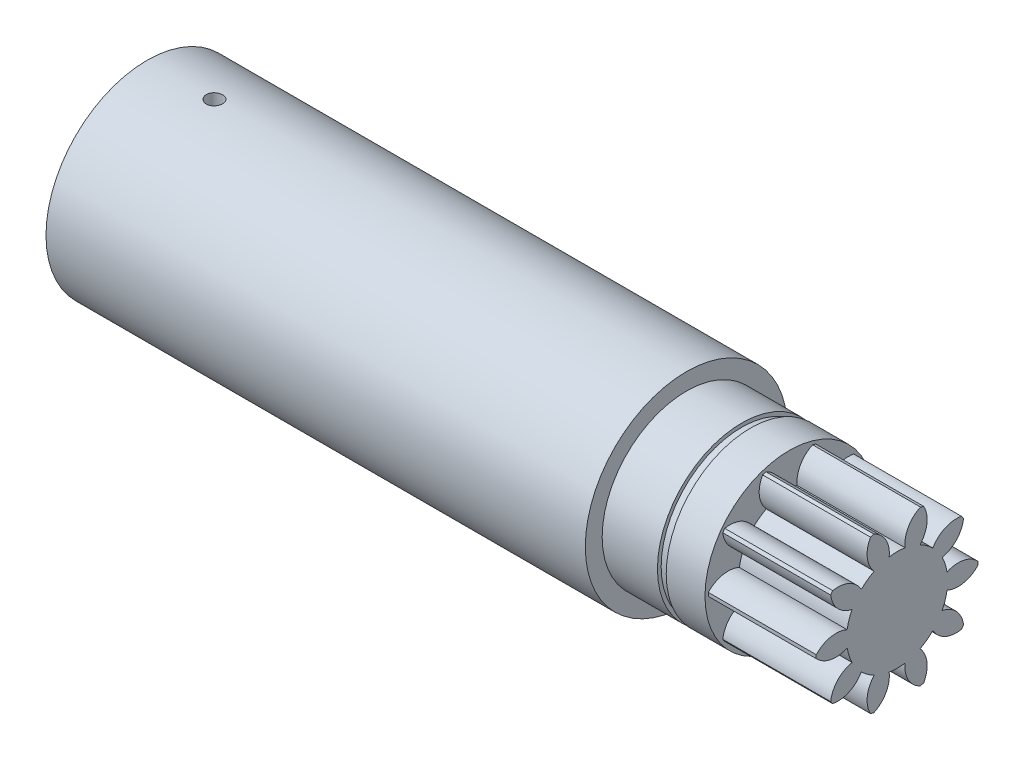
ISO-10303-21;
HEADER;
FILE_DESCRIPTION(('STEP AP214'),'2;1');
FILE_NAME('part.step','',(''),(''),'','','');
FILE_SCHEMA(('AUTOMOTIVE_DESIGN { 1 0 10303 214 1 1 1 1 }'));
ENDSEC;
DATA;
#1=APPLICATION_CONTEXT('core data for automotive mechanical design processes');
#2=APPLICATION_PROTOCOL_DEFINITION('international standard','automotive_design',2000,#1);
#3=PRODUCT_CONTEXT('',#1,'mechanical');
#4=PRODUCT('Part','Part','',(#3));
#5=PRODUCT_RELATED_PRODUCT_CATEGORY('part','',(#4));
#6=PRODUCT_DEFINITION_FORMATION('','',#4);
#7=PRODUCT_DEFINITION_CONTEXT('part definition',#1,'design');
#8=PRODUCT_DEFINITION('design','',#6,#7);
#9=PRODUCT_DEFINITION_SHAPE('','',#8);
#10=(LENGTH_UNIT() NAMED_UNIT(*) SI_UNIT(.MILLI.,.METRE.));
#11=(NAMED_UNIT(*) PLANE_ANGLE_UNIT() SI_UNIT($,.RADIAN.));
#12=(NAMED_UNIT(*) SI_UNIT($,.STERADIAN.) SOLID_ANGLE_UNIT());
#13=UNCERTAINTY_MEASURE_WITH_UNIT(LENGTH_MEASURE(1.E-05),#10,'distance_accuracy_value','');
#14=(GEOMETRIC_REPRESENTATION_CONTEXT(3) GLOBAL_UNCERTAINTY_ASSIGNED_CONTEXT((#13)) GLOBAL_UNIT_ASSIGNED_CONTEXT((#10,
#11,#12)) REPRESENTATION_CONTEXT('',''));
#15=CARTESIAN_POINT('',(0.,0.,0.));
#16=DIRECTION('',(0.,0.,1.));
#17=DIRECTION('',(1.,0.,0.));
#18=AXIS2_PLACEMENT_3D('',#15,#16,#17);
#19=CARTESIAN_POINT('',(-85.2499999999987,15.0000000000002,0.));
#20=DIRECTION('',(0.,0.999999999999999,0.));
#21=DIRECTION('',(0.,0.,0.999999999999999));
#22=AXIS2_PLACEMENT_3D('',#19,#20,#21);
#23=CYLINDRICAL_SURFACE('',#22,1.19999999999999);
#24=CARTESIAN_POINT('',(-85.2499999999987,9.92773891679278,1.20000000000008));
#25=CARTESIAN_POINT('',(-85.3171436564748,9.9277398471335,1.19999713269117));
#26=CARTESIAN_POINT('',(-85.3843298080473,9.92842743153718,1.19434565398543));
#27=CARTESIAN_POINT('',(-85.5168338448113,9.93110258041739,1.17188927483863));
#28=CARTESIAN_POINT('',(-85.5821496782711,9.93309151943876,1.15507258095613));
#29=CARTESIAN_POINT('',(-85.7089753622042,9.93814092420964,1.11078733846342));
#30=CARTESIAN_POINT('',(-85.7704877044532,9.94120067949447,1.08332585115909));
#31=CARTESIAN_POINT('',(-85.888018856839,9.94804609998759,1.01854535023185));
#32=CARTESIAN_POINT('',(-85.9440386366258,9.95183163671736,0.9812280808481));
#33=CARTESIAN_POINT('',(-86.0492959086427,9.959724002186,0.897588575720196));
#34=CARTESIAN_POINT('',(-86.0985009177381,9.96383223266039,0.851225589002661));
#35=CARTESIAN_POINT('',(-86.1884514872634,9.97189446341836,0.75089834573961));
#36=CARTESIAN_POINT('',(-86.2291966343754,9.97584845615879,0.696933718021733));
#37=CARTESIAN_POINT('',(-86.3011866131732,9.98317096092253,0.582731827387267));
#38=CARTESIAN_POINT('',(-86.3324021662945,9.9865376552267,0.522475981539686));
#39=CARTESIAN_POINT('',(-86.3842593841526,9.99229084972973,0.397530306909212));
#40=CARTESIAN_POINT('',(-86.4049014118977,9.99467738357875,0.332840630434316));
#41=CARTESIAN_POINT('',(-86.43492890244,9.99819149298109,0.201195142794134));
#42=CARTESIAN_POINT('',(-86.444368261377,9.99932509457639,0.134251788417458));
#43=CARTESIAN_POINT('',(-86.4518894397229,10.0002261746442,-0.000277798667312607));
#44=CARTESIAN_POINT('',(-86.4499716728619,9.99999370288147,-0.0678640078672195));
#45=CARTESIAN_POINT('',(-86.4348763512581,9.99819371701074,-0.201394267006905));
#46=CARTESIAN_POINT('',(-86.4217567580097,9.99663307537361,-0.26734497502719));
#47=CARTESIAN_POINT('',(-86.3847207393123,9.99235985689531,-0.396101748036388));
#48=CARTESIAN_POINT('',(-86.360804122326,9.9896472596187,-0.458907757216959));
#49=CARTESIAN_POINT('',(-86.3027909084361,9.98336311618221,-0.579772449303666));
#50=CARTESIAN_POINT('',(-86.2686691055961,9.97978944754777,-0.637818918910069));
#51=CARTESIAN_POINT('',(-86.1912324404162,9.97218323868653,-0.747383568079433));
#52=CARTESIAN_POINT('',(-86.1479171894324,9.96815067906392,-0.79890147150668));
#53=CARTESIAN_POINT('',(-86.0529982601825,9.96004826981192,-0.894286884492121));
#54=CARTESIAN_POINT('',(-86.0013440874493,9.95597834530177,-0.938104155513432));
#55=CARTESIAN_POINT('',(-85.8913873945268,9.94828504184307,-1.01645436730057));
#56=CARTESIAN_POINT('',(-85.8330848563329,9.9446616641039,-1.05098728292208));
#57=CARTESIAN_POINT('',(-85.7114430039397,9.9382716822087,-1.10979071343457));
#58=CARTESIAN_POINT('',(-85.6481018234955,9.93550539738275,-1.1340574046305));
#59=CARTESIAN_POINT('',(-85.5182030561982,9.93114913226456,-1.1715960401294));
#60=CARTESIAN_POINT('',(-85.451645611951,9.9295590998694,-1.18486847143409));
#61=CARTESIAN_POINT('',(-85.317646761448,9.92774480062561,-1.19997571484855));
#62=CARTESIAN_POINT('',(-85.2502134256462,9.92751210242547,-1.20188113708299));
#63=CARTESIAN_POINT('',(-85.1159884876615,9.92841653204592,-1.19438639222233));
#64=CARTESIAN_POINT('',(-85.0491968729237,9.9295536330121,-1.18498644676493));
#65=CARTESIAN_POINT('',(-84.9183616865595,9.93306185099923,-1.155207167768));
#66=CARTESIAN_POINT('',(-84.854310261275,9.93542914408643,-1.13486184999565));
#67=CARTESIAN_POINT('',(-84.7305282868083,9.94112791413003,-1.08380430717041));
#68=CARTESIAN_POINT('',(-84.6707978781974,9.94445942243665,-1.05309174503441));
#69=CARTESIAN_POINT('',(-84.5570334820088,9.95173149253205,-0.981997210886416));
#70=CARTESIAN_POINT('',(-84.5030286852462,9.95567494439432,-0.941568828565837));
#71=CARTESIAN_POINT('',(-84.402545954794,9.96371742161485,-0.852256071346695));
#72=CARTESIAN_POINT('',(-84.3560682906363,9.96781645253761,-0.803371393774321));
#73=CARTESIAN_POINT('',(-84.2717121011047,9.97573403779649,-0.698225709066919));
#74=CARTESIAN_POINT('',(-84.2338799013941,9.97955101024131,-0.641927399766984));
#75=CARTESIAN_POINT('',(-84.168208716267,9.9864508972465,-0.523734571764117));
#76=CARTESIAN_POINT('',(-84.1403695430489,9.98953382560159,-0.461840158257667));
#77=CARTESIAN_POINT('',(-84.0955515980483,9.99461121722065,-0.334367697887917));
#78=CARTESIAN_POINT('',(-84.078545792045,9.99660838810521,-0.268799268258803));
#79=CARTESIAN_POINT('',(-84.0557893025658,9.99930045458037,-0.135712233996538));
#80=CARTESIAN_POINT('',(-84.0500381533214,9.99999540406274,-0.0681937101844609));
#81=CARTESIAN_POINT('',(-84.0499624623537,10.000004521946,0.0664240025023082));
#82=CARTESIAN_POINT('',(-84.0555663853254,9.99932733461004,0.133523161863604));
#83=CARTESIAN_POINT('',(-84.0778905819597,9.99668541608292,0.265818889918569));
#84=CARTESIAN_POINT('',(-84.0946108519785,9.99472068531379,0.331015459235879));
#85=CARTESIAN_POINT('',(-84.1386712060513,9.98972352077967,0.457647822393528));
#86=CARTESIAN_POINT('',(-84.1660081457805,9.98669140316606,0.51908472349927));
#87=CARTESIAN_POINT('',(-84.2305184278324,9.97989569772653,0.636510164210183));
#88=CARTESIAN_POINT('',(-84.2676918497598,9.97613210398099,0.692498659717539));
#89=CARTESIAN_POINT('',(-84.3510854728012,9.96826557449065,0.797803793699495));
#90=CARTESIAN_POINT('',(-84.397358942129,9.96416072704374,0.847078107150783));
#91=CARTESIAN_POINT('',(-84.4975292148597,9.9560898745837,0.937190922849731));
#92=CARTESIAN_POINT('',(-84.5514278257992,9.95212390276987,0.978027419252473));
#93=CARTESIAN_POINT('',(-84.6655371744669,9.9447647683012,1.05022829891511));
#94=CARTESIAN_POINT('',(-84.7257697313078,9.94137369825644,1.08155839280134));
#95=CARTESIAN_POINT('',(-84.850647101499,9.93557289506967,1.133615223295));
#96=CARTESIAN_POINT('',(-84.9152869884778,9.9331620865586,1.15435358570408));
#97=CARTESIAN_POINT('',(-85.0252238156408,9.93018508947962,1.17962804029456));
#98=CARTESIAN_POINT('',(-85.0698251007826,9.92927229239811,1.18725665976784));
#99=CARTESIAN_POINT('',(-85.1596111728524,9.92804889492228,1.19744358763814));
#100=CARTESIAN_POINT('',(-85.2047959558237,9.92773829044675,1.20000193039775));
#101=CARTESIAN_POINT('',(-85.2499999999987,9.92773891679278,1.20000000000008));
#102=B_SPLINE_CURVE_WITH_KNOTS('',3,(#24,#25,#26,#27,#28,#29,#30,#31,#32,#33,#34,#35,#36,#37,
#38,#39,#40,#41,#42,#43,#44,#45,#46,#47,#48,#49,#50,#51,#52,#53,#54,#55,#56,#57,#58,#59,#60,#61,
#62,#63,#64,#65,#66,#67,#68,#69,#70,#71,#72,#73,#74,#75,#76,#77,#78,#79,#80,#81,#82,#83,#84,#85,
#86,#87,#88,#89,#90,#91,#92,#93,#94,#95,#96,#97,#98,#99,#100,#101),.UNSPECIFIED.,.T.,.F.,(4,2,2,
2,2,2,2,2,2,2,2,2,2,2,2,2,2,2,2,2,2,2,2,2,2,2,2,2,2,2,2,2,2,2,2,2,2,2,4),(0.,0.201265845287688,
0.402744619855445,0.604089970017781,0.805399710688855,1.00763821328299,1.20988659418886,
1.41275024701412,1.61560693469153,1.81748366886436,2.01935304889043,2.22018418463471,
2.42101888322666,2.62235378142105,2.8236971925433,3.02630897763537,3.22892131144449,
3.43160904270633,3.63428779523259,3.83570621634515,4.03712068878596,4.2379127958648,
4.43871143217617,4.64048900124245,4.84227379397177,5.04511571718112,5.24795382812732,
5.45028376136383,5.65260532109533,5.85365624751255,6.05470710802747,6.25569846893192,
6.45669145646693,6.6588980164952,6.86115259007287,7.0641282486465,7.2668806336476,
7.4023825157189,7.53788347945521),.UNSPECIFIED.);
#103=CARTESIAN_POINT('',(-85.2499999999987,9.92773891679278,1.20000000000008));
#104=VERTEX_POINT('',#103);
#105=EDGE_CURVE('E50',#104,#104,#102,.T.);
#106=ORIENTED_EDGE('',*,*,#105,.T.);
#107=EDGE_LOOP('',(#106));
#108=FACE_BOUND('',#107,.T.);
#109=CARTESIAN_POINT('',(-85.2499999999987,14.9519229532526,1.20000000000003));
#110=CARTESIAN_POINT('',(-85.3172887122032,14.9519235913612,1.1999970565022));
#111=CARTESIAN_POINT('',(-85.3846234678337,14.9523820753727,1.19432124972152));
#112=CARTESIAN_POINT('',(-85.5174305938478,14.9541664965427,1.17176255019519));
#113=CARTESIAN_POINT('',(-85.5829007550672,14.9554934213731,1.15486689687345));
#114=CARTESIAN_POINT('',(-85.7100359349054,14.9588634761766,1.11035967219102));
#115=CARTESIAN_POINT('',(-85.7717030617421,14.9609062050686,1.08275410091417));
#116=CARTESIAN_POINT('',(-85.8895134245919,14.9654772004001,1.01762116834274));
#117=CARTESIAN_POINT('',(-85.9456578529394,14.9680053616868,0.980095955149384));
#118=CARTESIAN_POINT('',(-86.0509774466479,14.9732691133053,0.896092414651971));
#119=CARTESIAN_POINT('',(-86.1001376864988,14.9760051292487,0.849595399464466));
#120=CARTESIAN_POINT('',(-86.1899652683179,14.9813724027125,0.749007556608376));
#121=CARTESIAN_POINT('',(-86.2306322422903,14.9840036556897,0.694916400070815));
#122=CARTESIAN_POINT('',(-86.3023680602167,14.9888689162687,0.580587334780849));
#123=CARTESIAN_POINT('',(-86.3334240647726,14.9911023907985,0.520341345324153));
#124=CARTESIAN_POINT('',(-86.3849742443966,14.9949158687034,0.39546919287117));
#125=CARTESIAN_POINT('',(-86.4054685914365,14.9964958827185,0.330843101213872));
#126=CARTESIAN_POINT('',(-86.435270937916,14.9988214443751,0.199193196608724));
#127=CARTESIAN_POINT('',(-86.4446029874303,14.999568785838,0.132174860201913));
#128=CARTESIAN_POINT('',(-86.4518901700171,15.0001508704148,-0.00248081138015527));
#129=CARTESIAN_POINT('',(-86.4498454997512,14.9999856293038,-0.0701181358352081));
#130=CARTESIAN_POINT('',(-86.4344569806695,14.998762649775,-0.203928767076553));
#131=CARTESIAN_POINT('',(-86.4211389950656,14.9977069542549,-0.27010506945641));
#132=CARTESIAN_POINT('',(-86.3836220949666,14.9948241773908,-0.399279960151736));
#133=CARTESIAN_POINT('',(-86.3594230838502,14.9929970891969,-0.46227852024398));
#134=CARTESIAN_POINT('',(-86.3008021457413,14.9887735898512,-0.583392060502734));
#135=CARTESIAN_POINT('',(-86.2663686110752,14.9863765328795,-0.641501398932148));
#136=CARTESIAN_POINT('',(-86.1882644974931,14.9812825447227,-0.751125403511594));
#137=CARTESIAN_POINT('',(-86.1445937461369,14.9785856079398,-0.80263994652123));
#138=CARTESIAN_POINT('',(-86.0491090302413,14.9731861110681,-0.897763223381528));
#139=CARTESIAN_POINT('',(-85.997272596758,14.9704835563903,-0.941349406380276));
#140=CARTESIAN_POINT('',(-85.8870063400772,14.9653850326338,-1.01920455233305));
#141=CARTESIAN_POINT('',(-85.8285765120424,14.96298906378,-1.05347350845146));
#142=CARTESIAN_POINT('',(-85.706766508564,14.9587745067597,-1.11172043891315));
#143=CARTESIAN_POINT('',(-85.6433857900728,14.9569559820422,-1.1356972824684));
#144=CARTESIAN_POINT('',(-85.5134805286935,14.954103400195,-1.17266287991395));
#145=CARTESIAN_POINT('',(-85.4469560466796,14.9530693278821,-1.18565184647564));
#146=CARTESIAN_POINT('',(-85.3128488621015,14.9519051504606,-1.20024451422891));
#147=CARTESIAN_POINT('',(-85.245269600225,14.9517725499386,-1.20187964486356));
#148=CARTESIAN_POINT('',(-85.1107979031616,14.9524197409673,-1.19380051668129));
#149=CARTESIAN_POINT('',(-85.0439054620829,14.9531995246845,-1.18408635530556));
#150=CARTESIAN_POINT('',(-84.9127962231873,14.955581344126,-1.15361057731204));
#151=CARTESIAN_POINT('',(-84.8485760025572,14.9571822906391,-1.13286359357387));
#152=CARTESIAN_POINT('',(-84.7245282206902,14.9610251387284,-1.08092596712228));
#153=CARTESIAN_POINT('',(-84.6647007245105,14.9632670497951,-1.04973516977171));
#154=CARTESIAN_POINT('',(-84.5509927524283,14.968145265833,-0.977715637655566));
#155=CARTESIAN_POINT('',(-84.4971255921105,14.9707824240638,-0.936865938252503));
#156=CARTESIAN_POINT('',(-84.3970018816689,14.9761510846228,-0.846718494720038));
#157=CARTESIAN_POINT('',(-84.3507454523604,14.9788825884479,-0.797420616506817));
#158=CARTESIAN_POINT('',(-84.2670491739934,14.9841395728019,-0.691640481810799));
#159=CARTESIAN_POINT('',(-84.2296297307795,14.9866645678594,-0.635142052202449));
#160=CARTESIAN_POINT('',(-84.1648095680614,14.9912170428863,-0.516645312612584));
#161=CARTESIAN_POINT('',(-84.1374087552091,14.9932445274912,-0.454647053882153));
#162=CARTESIAN_POINT('',(-84.0934387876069,14.9965712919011,-0.326984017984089));
#163=CARTESIAN_POINT('',(-84.0768569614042,14.9978714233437,-0.261323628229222));
#164=CARTESIAN_POINT('',(-84.0549542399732,14.9996004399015,-0.128139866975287));
#165=CARTESIAN_POINT('',(-84.0496331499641,15.0000293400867,-0.0606165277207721));
#166=CARTESIAN_POINT('',(-84.0504051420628,14.9999675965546,0.0741751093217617));
#167=CARTESIAN_POINT('',(-84.0564663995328,14.999479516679,0.141443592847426));
#168=CARTESIAN_POINT('',(-84.0797647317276,14.9976437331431,0.274004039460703));
#169=CARTESIAN_POINT('',(-84.0970018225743,14.9962960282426,0.339295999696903));
#170=CARTESIAN_POINT('',(-84.1421545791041,14.9928922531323,0.466052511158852));
#171=CARTESIAN_POINT('',(-84.1700697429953,14.9908362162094,0.527517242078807));
#172=CARTESIAN_POINT('',(-84.2357825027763,14.9862459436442,0.644892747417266));
#173=CARTESIAN_POINT('',(-84.2735799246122,14.9837117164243,0.700803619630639));
#174=CARTESIAN_POINT('',(-84.358103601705,14.9784411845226,0.80564703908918));
#175=CARTESIAN_POINT('',(-84.404853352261,14.9757043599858,0.854560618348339));
#176=CARTESIAN_POINT('',(-84.5059133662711,14.970341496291,0.94386579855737));
#177=CARTESIAN_POINT('',(-84.560225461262,14.9677154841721,0.984255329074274));
#178=CARTESIAN_POINT('',(-84.6749659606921,14.9628665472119,1.0554160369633));
#179=CARTESIAN_POINT('',(-84.7354049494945,14.9606443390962,1.08617018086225));
#180=CARTESIAN_POINT('',(-84.8605648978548,14.95686342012,1.13705484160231));
#181=CARTESIAN_POINT('',(-84.925280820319,14.955303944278,1.15719761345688));
#182=CARTESIAN_POINT('',(-85.0336509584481,14.9534275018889,1.18113870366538));
#183=CARTESIAN_POINT('',(-85.0766075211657,14.9528658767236,1.18820233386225));
#184=CARTESIAN_POINT('',(-85.1630363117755,14.95211339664,1.19763392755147));
#185=CARTESIAN_POINT('',(-85.2065085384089,14.9519225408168,1.20000190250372));
#186=CARTESIAN_POINT('',(-85.2499999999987,14.9519229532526,1.20000000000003));
#187=B_SPLINE_CURVE_WITH_KNOTS('',3,(#109,#110,#111,#112,#113,#114,#115,#116,#117,#118,#119,
#120,#121,#122,#123,#124,#125,#126,#127,#128,#129,#130,#131,#132,#133,#134,#135,#136,#137,#138,
#139,#140,#141,#142,#143,#144,#145,#146,#147,#148,#149,#150,#151,#152,#153,#154,#155,#156,#157,
#158,#159,#160,#161,#162,#163,#164,#165,#166,#167,#168,#169,#170,#171,#172,#173,#174,#175,#176,
#177,#178,#179,#180,#181,#182,#183,#184,#185,#186),.UNSPECIFIED.,.T.,.F.,(4,2,2,2,2,2,2,2,2,2,2,
2,2,2,2,2,2,2,2,2,2,2,2,2,2,2,2,2,2,2,2,2,2,2,2,2,2,2,4),(0.,0.201707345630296,
0.403644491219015,0.605468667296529,0.807249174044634,1.00945460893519,1.21166880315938,
1.4141519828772,1.61663186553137,1.81867469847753,2.0207140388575,2.22229111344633,
2.42386997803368,2.62567834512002,2.82749047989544,3.02986795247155,3.23224557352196,
3.43464542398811,3.63704135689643,3.83887679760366,4.04071050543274,4.24227718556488,
4.44384685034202,4.6458581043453,4.8478725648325,5.05034904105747,5.25282363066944,
5.45506064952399,5.65729417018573,5.85896309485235,6.0606323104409,6.26229205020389,
6.46394823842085,6.6661411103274,6.86838303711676,7.07098049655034,7.27334346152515,
7.40371553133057,7.53408728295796),.UNSPECIFIED.);
#188=CARTESIAN_POINT('',(-85.2499999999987,14.9519229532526,1.20000000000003));
#189=VERTEX_POINT('',#188);
#190=EDGE_CURVE('E59',#189,#189,#187,.T.);
#191=ORIENTED_EDGE('',*,*,#190,.F.);
#192=EDGE_LOOP('',(#191));
#193=FACE_BOUND('',#192,.T.);
#194=ADVANCED_FACE('F46',(#108,#193),#23,.F.);
#195=CARTESIAN_POINT('',(-5.75,3.60822483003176E-13,1.66533453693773E-13));
#196=DIRECTION('',(-1.,0.,0.));
#197=DIRECTION('',(0.,0.,0.999999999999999));
#198=AXIS2_PLACEMENT_3D('',#195,#196,#197);
#199=PLANE('',#198);
#200=CARTESIAN_POINT('',(-5.75,3.60822483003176E-13,1.66533453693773E-13));
#201=DIRECTION('',(-1.,0.,0.));
#202=DIRECTION('',(0.,0.,0.999999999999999));
#203=AXIS2_PLACEMENT_3D('',#200,#201,#202);
#204=CIRCLE('',#203,12.5);
#205=CARTESIAN_POINT('',(-5.75,3.60822483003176E-13,12.5000000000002));
#206=VERTEX_POINT('',#205);
#207=EDGE_CURVE('E393',#206,#206,#204,.T.);
#208=ORIENTED_EDGE('',*,*,#207,.T.);
#209=EDGE_LOOP('',(#208));
#210=FACE_BOUND('',#209,.T.);
#211=CARTESIAN_POINT('',(-5.75,3.60822483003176E-13,1.66533453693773E-13));
#212=DIRECTION('',(-1.,0.,0.));
#213=DIRECTION('',(0.,0.,0.999999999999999));
#214=AXIS2_PLACEMENT_3D('',#211,#212,#213);
#215=CIRCLE('',#214,11.95);
#216=CARTESIAN_POINT('',(-5.75,3.60822483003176E-13,11.9500000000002));
#217=VERTEX_POINT('',#216);
#218=EDGE_CURVE('E384',#217,#217,#215,.T.);
#219=ORIENTED_EDGE('',*,*,#218,.F.);
#220=EDGE_LOOP('',(#219));
#221=FACE_BOUND('',#220,.T.);
#222=ADVANCED_FACE('F682',(#210,#221),#199,.T.);
#223=CARTESIAN_POINT('',(16.,0.,0.));
#224=DIRECTION('',(-1.,0.,0.));
#225=DIRECTION('',(0.,0.,0.999999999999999));
#226=AXIS2_PLACEMENT_3D('',#223,#224,#225);
#227=PLANE('',#226);
#228=CARTESIAN_POINT('',(16.,2.4664227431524,9.06746828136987));
#229=DIRECTION('',(-1.,0.,0.));
#230=DIRECTION('',(0.,0.951056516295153,0.309016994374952));
#231=AXIS2_PLACEMENT_3D('',#228,#229,#230);
#232=CIRCLE('',#231,4.);
#233=CARTESIAN_POINT('',(16.,-1.17254140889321,7.40676364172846));
#234=VERTEX_POINT('',#233);
#235=CARTESIAN_POINT('',(16.,-0.256880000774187,11.9972502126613));
#236=VERTEX_POINT('',#235);
#237=EDGE_CURVE('E526',#234,#236,#232,.T.);
#238=ORIENTED_EDGE('',*,*,#237,.F.);
#239=CARTESIAN_POINT('',(16.,0.,0.));
#240=DIRECTION('',(-1.,0.,0.));
#241=DIRECTION('',(0.,0.951056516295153,0.309016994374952));
#242=AXIS2_PLACEMENT_3D('',#239,#240,#241);
#243=CIRCLE('',#242,7.499);
#244=CARTESIAN_POINT('',(16.,-3.4049805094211,6.68140020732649));
#245=VERTEX_POINT('',#244);
#246=EDGE_CURVE('E531',#245,#234,#243,.T.);
#247=ORIENTED_EDGE('',*,*,#246,.F.);
#248=CARTESIAN_POINT('',(16.,-7.32510204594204,5.88600902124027));
#249=DIRECTION('',(-1.,0.,0.));
#250=DIRECTION('',(0.,0.951056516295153,0.309016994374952));
#251=AXIS2_PLACEMENT_3D('',#248,#249,#250);
#252=CIRCLE('',#251,4.);
#253=CARTESIAN_POINT('',(16.,-6.84398645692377,9.85696958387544));
#254=VERTEX_POINT('',#253);
#255=EDGE_CURVE('E528',#254,#245,#252,.T.);
#256=ORIENTED_EDGE('',*,*,#255,.F.);
#257=CARTESIAN_POINT('',(16.,0.,0.));
#258=DIRECTION('',(-1.,0.,0.));
#259=DIRECTION('',(0.,0.,0.999999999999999));
#260=AXIS2_PLACEMENT_3D('',#257,#258,#259);
#261=CIRCLE('',#260,12.);
#262=CARTESIAN_POINT('',(16.,-7.25962702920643,9.55498903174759));
#263=VERTEX_POINT('',#262);
#264=EDGE_CURVE('E900',#263,#254,#261,.T.);
#265=ORIENTED_EDGE('',*,*,#264,.F.);
#266=CARTESIAN_POINT('',(16.,-3.33434621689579,8.78546284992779));
#267=DIRECTION('',(-1.,0.,0.));
#268=DIRECTION('',(0.,0.587785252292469,0.809016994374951));
#269=AXIS2_PLACEMENT_3D('',#266,#267,#268);
#270=CIRCLE('',#269,4.);
#271=CARTESIAN_POINT('',(16.,-5.30219236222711,5.30299511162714));
#272=VERTEX_POINT('',#271);
#273=EDGE_CURVE('E504',#272,#263,#270,.T.);
#274=ORIENTED_EDGE('',*,*,#273,.F.);
#275=CARTESIAN_POINT('',(16.,0.,0.));
#276=DIRECTION('',(-1.,0.,0.));
#277=DIRECTION('',(0.,0.587785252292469,0.809016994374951));
#278=AXIS2_PLACEMENT_3D('',#275,#276,#277);
#279=CIRCLE('',#278,7.499);
#280=CARTESIAN_POINT('',(16.,-6.68191560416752,3.40396898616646));
#281=VERTEX_POINT('',#280);
#282=EDGE_CURVE('E509',#281,#272,#279,.T.);
#283=ORIENTED_EDGE('',*,*,#282,.F.);
#284=CARTESIAN_POINT('',(16.,-9.38584133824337,0.456294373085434));
#285=DIRECTION('',(-1.,0.,0.));
#286=DIRECTION('',(0.,0.587785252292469,0.809016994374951));
#287=AXIS2_PLACEMENT_3D('',#284,#285,#286);
#288=CIRCLE('',#287,4.);
#289=CARTESIAN_POINT('',(16.,-11.3306827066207,3.95166160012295));
#290=VERTEX_POINT('',#289);
#291=EDGE_CURVE('E506',#290,#281,#288,.T.);
#292=ORIENTED_EDGE('',*,*,#291,.F.);
#293=CARTESIAN_POINT('',(16.,-11.4894432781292,3.46304680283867));
#294=VERTEX_POINT('',#293);
#295=EDGE_CURVE('E895',#294,#290,#261,.T.);
#296=ORIENTED_EDGE('',*,*,#295,.F.);
#297=CARTESIAN_POINT('',(16.,-7.86150825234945,5.14770921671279));
#298=DIRECTION('',(-1.,0.,0.));
#299=DIRECTION('',(0.,0.,0.999999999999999));
#300=AXIS2_PLACEMENT_3D('',#297,#298,#299);
#301=CIRCLE('',#300,4.);
#302=CARTESIAN_POINT('',(16.,-7.40658604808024,1.17366269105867));
#303=VERTEX_POINT('',#302);
#304=EDGE_CURVE('E482',#303,#294,#301,.T.);
#305=ORIENTED_EDGE('',*,*,#304,.F.);
#306=CARTESIAN_POINT('',(16.,0.,0.));
#307=DIRECTION('',(-1.,0.,0.));
#308=DIRECTION('',(0.,0.,0.999999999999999));
#309=AXIS2_PLACEMENT_3D('',#306,#307,#308);
#310=CIRCLE('',#309,7.499);
#311=CARTESIAN_POINT('',(16.,-7.40658604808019,-1.17366269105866));
#312=VERTEX_POINT('',#311);
#313=EDGE_CURVE('E487',#312,#303,#310,.T.);
#314=ORIENTED_EDGE('',*,*,#313,.F.);
#315=CARTESIAN_POINT('',(16.,-7.86150825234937,-5.14770921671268));
#316=DIRECTION('',(-1.,0.,0.));
#317=DIRECTION('',(0.,0.,0.999999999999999));
#318=AXIS2_PLACEMENT_3D('',#315,#316,#317);
#319=CIRCLE('',#318,4.);
#320=CARTESIAN_POINT('',(16.,-11.4894432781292,-3.46304680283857));
#321=VERTEX_POINT('',#320);
#322=EDGE_CURVE('E484',#321,#312,#319,.T.);
#323=ORIENTED_EDGE('',*,*,#322,.F.);
#324=CARTESIAN_POINT('',(16.,-11.3306827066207,-3.95166160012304));
#325=VERTEX_POINT('',#324);
#326=EDGE_CURVE('E890',#325,#321,#261,.T.);
#327=ORIENTED_EDGE('',*,*,#326,.F.);
#328=CARTESIAN_POINT('',(16.,-9.38584133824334,-0.456294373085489));
#329=DIRECTION('',(-1.,0.,0.));
#330=DIRECTION('',(0.,-0.58778525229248,0.809016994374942));
#331=AXIS2_PLACEMENT_3D('',#328,#329,#330);
#332=CIRCLE('',#331,4.);
#333=CARTESIAN_POINT('',(16.,-6.68191560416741,-3.40396898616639));
#334=VERTEX_POINT('',#333);
#335=EDGE_CURVE('E460',#334,#325,#332,.T.);
#336=ORIENTED_EDGE('',*,*,#335,.F.);
#337=CARTESIAN_POINT('',(16.,0.,0.));
#338=DIRECTION('',(-1.,0.,0.));
#339=DIRECTION('',(0.,-0.58778525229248,0.809016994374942));
#340=AXIS2_PLACEMENT_3D('',#337,#338,#339);
#341=CIRCLE('',#340,7.499);
#342=CARTESIAN_POINT('',(16.,-5.30219236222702,-5.30299511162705));
#343=VERTEX_POINT('',#342);
#344=EDGE_CURVE('E465',#343,#334,#341,.T.);
#345=ORIENTED_EDGE('',*,*,#344,.F.);
#346=CARTESIAN_POINT('',(16.,-3.33434621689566,-8.78546284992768));
#347=DIRECTION('',(-1.,0.,0.));
#348=DIRECTION('',(0.,-0.58778525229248,0.809016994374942));
#349=AXIS2_PLACEMENT_3D('',#346,#347,#348);
#350=CIRCLE('',#349,4.);
#351=CARTESIAN_POINT('',(16.,-7.2596270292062,-9.55498903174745));
#352=VERTEX_POINT('',#351);
#353=EDGE_CURVE('E462',#352,#343,#350,.T.);
#354=ORIENTED_EDGE('',*,*,#353,.F.);
#355=CARTESIAN_POINT('',(16.,-6.84398645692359,-9.85696958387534));
#356=VERTEX_POINT('',#355);
#357=EDGE_CURVE('E885',#356,#352,#261,.T.);
#358=ORIENTED_EDGE('',*,*,#357,.F.);
#359=CARTESIAN_POINT('',(16.,-7.32510204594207,-5.88600902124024));
#360=DIRECTION('',(-1.,0.,0.));
#361=DIRECTION('',(0.,-0.951056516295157,0.309016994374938));
#362=AXIS2_PLACEMENT_3D('',#359,#360,#361);
#363=CIRCLE('',#362,4.);
#364=CARTESIAN_POINT('',(16.,-3.40498050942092,-6.68140020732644));
#365=VERTEX_POINT('',#364);
#366=EDGE_CURVE('E438',#365,#356,#363,.T.);
#367=ORIENTED_EDGE('',*,*,#366,.F.);
#368=CARTESIAN_POINT('',(16.,0.,0.));
#369=DIRECTION('',(-1.,0.,0.));
#370=DIRECTION('',(0.,-0.951056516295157,0.309016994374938));
#371=AXIS2_PLACEMENT_3D('',#368,#369,#370);
#372=CIRCLE('',#371,7.499);
#373=CARTESIAN_POINT('',(16.,-1.1725414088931,-7.40676364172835));
#374=VERTEX_POINT('',#373);
#375=EDGE_CURVE('E443',#374,#365,#372,.T.);
#376=ORIENTED_EDGE('',*,*,#375,.F.);
#377=CARTESIAN_POINT('',(16.,2.46642274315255,-9.06746828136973));
#378=DIRECTION('',(-1.,0.,0.));
#379=DIRECTION('',(0.,-0.951056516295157,0.309016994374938));
#380=AXIS2_PLACEMENT_3D('',#377,#378,#379);
#381=CIRCLE('',#380,4.);
#382=CARTESIAN_POINT('',(16.,-0.256880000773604,-11.9972502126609));
#383=VERTEX_POINT('',#382);
#384=EDGE_CURVE('E440',#383,#374,#381,.T.);
#385=ORIENTED_EDGE('',*,*,#384,.F.);
#386=CARTESIAN_POINT('',(16.,0.256880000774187,-11.9972502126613));
#387=VERTEX_POINT('',#386);
#388=EDGE_CURVE('E884',#387,#383,#261,.T.);
#389=ORIENTED_EDGE('',*,*,#388,.F.);
#390=CARTESIAN_POINT('',(16.,-2.4664227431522,-9.0674682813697));
#391=DIRECTION('',(-1.,0.,0.));
#392=DIRECTION('',(0.,-0.95105651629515,-0.309016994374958));
#393=AXIS2_PLACEMENT_3D('',#390,#391,#392);
#394=CIRCLE('',#393,4.);
#395=CARTESIAN_POINT('',(16.,1.17254140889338,-7.40676364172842));
#396=VERTEX_POINT('',#395);
#397=EDGE_CURVE('E418',#396,#387,#394,.T.);
#398=ORIENTED_EDGE('',*,*,#397,.F.);
#399=CARTESIAN_POINT('',(16.,0.,0.));
#400=DIRECTION('',(-1.,0.,0.));
#401=DIRECTION('',(0.,-0.95105651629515,-0.309016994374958));
#402=AXIS2_PLACEMENT_3D('',#399,#400,#401);
#403=CIRCLE('',#402,7.499);
#404=CARTESIAN_POINT('',(16.,3.40498050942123,-6.68140020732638));
#405=VERTEX_POINT('',#404);
#406=EDGE_CURVE('E423',#405,#396,#403,.T.);
#407=ORIENTED_EDGE('',*,*,#406,.F.);
#408=CARTESIAN_POINT('',(16.,7.32510204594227,-5.88600902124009));
#409=DIRECTION('',(-1.,0.,0.));
#410=DIRECTION('',(0.,-0.95105651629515,-0.309016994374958));
#411=AXIS2_PLACEMENT_3D('',#408,#409,#410);
#412=CIRCLE('',#411,4.);
#413=CARTESIAN_POINT('',(16.,6.84398645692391,-9.85696958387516));
#414=VERTEX_POINT('',#413);
#415=EDGE_CURVE('E420',#414,#405,#412,.T.);
#416=ORIENTED_EDGE('',*,*,#415,.F.);
#417=CARTESIAN_POINT('',(16.,7.25962702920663,-9.55498903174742));
#418=VERTEX_POINT('',#417);
#419=EDGE_CURVE('E623',#418,#414,#261,.T.);
#420=ORIENTED_EDGE('',*,*,#419,.F.);
#421=CARTESIAN_POINT('',(16.,3.33434621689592,-8.78546284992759));
#422=DIRECTION('',(-1.,0.,0.));
#423=DIRECTION('',(0.,-0.587785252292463,-0.809016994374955));
#424=AXIS2_PLACEMENT_3D('',#421,#422,#423);
#425=CIRCLE('',#424,4.);
#426=CARTESIAN_POINT('',(16.,5.30219236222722,-5.30299511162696));
#427=VERTEX_POINT('',#426);
#428=EDGE_CURVE('E399',#427,#418,#425,.T.);
#429=ORIENTED_EDGE('',*,*,#428,.F.);
#430=CARTESIAN_POINT('',(16.,0.,0.));
#431=DIRECTION('',(-1.,0.,0.));
#432=DIRECTION('',(0.,-0.587785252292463,-0.809016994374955));
#433=AXIS2_PLACEMENT_3D('',#430,#431,#432);
#434=CIRCLE('',#433,7.499);
#435=CARTESIAN_POINT('',(16.,6.68191560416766,-3.40396898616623));
#436=VERTEX_POINT('',#435);
#437=EDGE_CURVE('E404',#436,#427,#434,.T.);
#438=ORIENTED_EDGE('',*,*,#437,.F.);
#439=CARTESIAN_POINT('',(16.,9.38584133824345,-0.456294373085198));
#440=DIRECTION('',(-1.,0.,0.));
#441=DIRECTION('',(0.,-0.587785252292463,-0.809016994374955));
#442=AXIS2_PLACEMENT_3D('',#439,#440,#441);
#443=CIRCLE('',#442,4.);
#444=CARTESIAN_POINT('',(16.,11.3306827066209,-3.9516616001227));
#445=VERTEX_POINT('',#444);
#446=EDGE_CURVE('E401',#445,#436,#443,.T.);
#447=ORIENTED_EDGE('',*,*,#446,.F.);
#448=CARTESIAN_POINT('',(16.,11.4894432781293,-3.46304680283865));
#449=VERTEX_POINT('',#448);
#450=EDGE_CURVE('E619',#449,#445,#261,.T.);
#451=ORIENTED_EDGE('',*,*,#450,.F.);
#452=CARTESIAN_POINT('',(16.,7.86150825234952,-5.14770921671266));
#453=DIRECTION('',(-1.,0.,0.));
#454=DIRECTION('',(0.,0.,-0.999999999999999));
#455=AXIS2_PLACEMENT_3D('',#452,#453,#454);
#456=CIRCLE('',#455,4.);
#457=CARTESIAN_POINT('',(16.,7.40658604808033,-1.17366269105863));
#458=VERTEX_POINT('',#457);
#459=EDGE_CURVE('E597',#458,#449,#456,.T.);
#460=ORIENTED_EDGE('',*,*,#459,.F.);
#461=CARTESIAN_POINT('',(16.,0.,0.));
#462=DIRECTION('',(-1.,0.,0.));
#463=DIRECTION('',(0.,0.,-0.999999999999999));
#464=AXIS2_PLACEMENT_3D('',#461,#462,#463);
#465=CIRCLE('',#464,7.499);
#466=CARTESIAN_POINT('',(16.,7.40658604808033,1.17366269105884));
#467=VERTEX_POINT('',#466);
#468=EDGE_CURVE('E601',#467,#458,#465,.T.);
#469=ORIENTED_EDGE('',*,*,#468,.F.);
#470=CARTESIAN_POINT('',(16.,7.86150825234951,5.14770921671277));
#471=DIRECTION('',(-1.,0.,0.));
#472=DIRECTION('',(0.,0.,-0.999999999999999));
#473=AXIS2_PLACEMENT_3D('',#470,#471,#472);
#474=CIRCLE('',#473,4.);
#475=CARTESIAN_POINT('',(16.,11.4894432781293,3.46304680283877));
#476=VERTEX_POINT('',#475);
#477=EDGE_CURVE('E599',#476,#467,#474,.T.);
#478=ORIENTED_EDGE('',*,*,#477,.F.);
#479=CARTESIAN_POINT('',(16.,11.3306827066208,3.95166160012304));
#480=VERTEX_POINT('',#479);
#481=EDGE_CURVE('E617',#480,#476,#261,.T.);
#482=ORIENTED_EDGE('',*,*,#481,.F.);
#483=CARTESIAN_POINT('',(16.,9.38584133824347,0.456294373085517));
#484=DIRECTION('',(-1.,0.,0.));
#485=DIRECTION('',(0.,0.587785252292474,-0.809016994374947));
#486=AXIS2_PLACEMENT_3D('',#483,#484,#485);
#487=CIRCLE('',#486,4.);
#488=CARTESIAN_POINT('',(16.,6.68191560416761,3.4039689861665));
#489=VERTEX_POINT('',#488);
#490=EDGE_CURVE('E570',#489,#480,#487,.T.);
#491=ORIENTED_EDGE('',*,*,#490,.F.);
#492=CARTESIAN_POINT('',(16.,0.,0.));
#493=DIRECTION('',(-1.,0.,0.));
#494=DIRECTION('',(0.,0.587785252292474,-0.809016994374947));
#495=AXIS2_PLACEMENT_3D('',#492,#493,#494);
#496=CIRCLE('',#495,7.499);
#497=CARTESIAN_POINT('',(16.,5.30219236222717,5.30299511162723));
#498=VERTEX_POINT('',#497);
#499=EDGE_CURVE('E575',#498,#489,#496,.T.);
#500=ORIENTED_EDGE('',*,*,#499,.F.);
#501=CARTESIAN_POINT('',(16.,3.33434621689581,8.78546284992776));
#502=DIRECTION('',(-1.,0.,0.));
#503=DIRECTION('',(0.,0.587785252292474,-0.809016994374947));
#504=AXIS2_PLACEMENT_3D('',#501,#502,#503);
#505=CIRCLE('',#504,4.);
#506=CARTESIAN_POINT('',(16.,7.25962702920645,9.55498903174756));
#507=VERTEX_POINT('',#506);
#508=EDGE_CURVE('E572',#507,#498,#505,.T.);
#509=ORIENTED_EDGE('',*,*,#508,.F.);
#510=CARTESIAN_POINT('',(16.,6.84398645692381,9.85696958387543));
#511=VERTEX_POINT('',#510);
#512=EDGE_CURVE('E910',#511,#507,#261,.T.);
#513=ORIENTED_EDGE('',*,*,#512,.F.);
#514=CARTESIAN_POINT('',(16.,7.32510204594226,5.88600902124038));
#515=DIRECTION('',(-1.,0.,0.));
#516=DIRECTION('',(0.,0.951056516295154,-0.309016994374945));
#517=AXIS2_PLACEMENT_3D('',#514,#515,#516);
#518=CIRCLE('',#517,4.);
#519=CARTESIAN_POINT('',(16.,3.40498050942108,6.68140020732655));
#520=VERTEX_POINT('',#519);
#521=EDGE_CURVE('E548',#520,#511,#518,.T.);
#522=ORIENTED_EDGE('',*,*,#521,.F.);
#523=CARTESIAN_POINT('',(16.,0.,0.));
#524=DIRECTION('',(-1.,0.,0.));
#525=DIRECTION('',(0.,0.951056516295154,-0.309016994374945));
#526=AXIS2_PLACEMENT_3D('',#523,#524,#525);
#527=CIRCLE('',#526,7.499);
#528=CARTESIAN_POINT('',(16.,1.17254140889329,7.4067636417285));
#529=VERTEX_POINT('',#528);
#530=EDGE_CURVE('E553',#529,#520,#527,.T.);
#531=ORIENTED_EDGE('',*,*,#530,.F.);
#532=CARTESIAN_POINT('',(16.,-2.46642274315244,9.06746828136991));
#533=DIRECTION('',(-1.,0.,0.));
#534=DIRECTION('',(0.,0.951056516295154,-0.309016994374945));
#535=AXIS2_PLACEMENT_3D('',#532,#533,#534);
#536=CIRCLE('',#535,4.);
#537=CARTESIAN_POINT('',(16.,0.256880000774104,11.9972502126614));
#538=VERTEX_POINT('',#537);
#539=EDGE_CURVE('E550',#538,#529,#536,.T.);
#540=ORIENTED_EDGE('',*,*,#539,.F.);
#541=EDGE_CURVE('E905',#236,#538,#261,.T.);
#542=ORIENTED_EDGE('',*,*,#541,.F.);
#543=EDGE_LOOP('',(#238,#247,#256,#265,#274,#283,#292,#296,#305,#314,#323,#327,#336,#345,#354,
#358,#367,#376,#385,#389,#398,#407,#416,#420,#429,#438,#447,#451,#460,#469,#478,#482,#491,#500,
#509,#513,#522,#531,#540,#542));
#544=FACE_BOUND('',#543,.T.);
#545=ADVANCED_FACE('F48',(#544),#227,.F.);
#546=CARTESIAN_POINT('',(-10.,3.60822483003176E-13,1.66533453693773E-13));
#547=DIRECTION('',(-1.,0.,0.));
#548=DIRECTION('',(0.,0.,0.999999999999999));
#549=AXIS2_PLACEMENT_3D('',#546,#547,#548);
#550=CYLINDRICAL_SURFACE('',#549,12.);
#551=DIRECTION('',(-1.,0.,0.));
#552=VECTOR('',#551,1.);
#553=CARTESIAN_POINT('',(8.,7.2596270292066,-9.5549890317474));
#554=LINE('',#553,#552);
#555=CARTESIAN_POINT('',(0.,7.25962702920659,-9.55498903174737));
#556=VERTEX_POINT('',#555);
#557=EDGE_CURVE('E416',#418,#556,#554,.T.);
#558=ORIENTED_EDGE('',*,*,#557,.F.);
#559=ORIENTED_EDGE('',*,*,#419,.T.);
#560=DIRECTION('',(-1.,0.,0.));
#561=VECTOR('',#560,1.);
#562=CARTESIAN_POINT('',(8.,6.84398645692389,-9.85696958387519));
#563=LINE('',#562,#561);
#564=CARTESIAN_POINT('',(0.,6.84398645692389,-9.85696958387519));
#565=VERTEX_POINT('',#564);
#566=EDGE_CURVE('E432',#565,#414,#563,.F.);
#567=ORIENTED_EDGE('',*,*,#566,.F.);
#568=CARTESIAN_POINT('',(0.,0.,0.));
#569=DIRECTION('',(-1.,0.,0.));
#570=DIRECTION('',(0.,0.,0.999999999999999));
#571=AXIS2_PLACEMENT_3D('',#568,#569,#570);
#572=CIRCLE('',#571,12.);
#573=EDGE_CURVE('E618',#556,#565,#572,.T.);
#574=ORIENTED_EDGE('',*,*,#573,.F.);
#575=EDGE_LOOP('',(#558,#559,#567,#574));
#576=FACE_BOUND('',#575,.T.);
#577=ADVANCED_FACE('F856',(#576),#550,.T.);
#578=DIRECTION('',(-1.,0.,0.));
#579=VECTOR('',#578,1.);
#580=CARTESIAN_POINT('',(8.,11.3306827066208,-3.9516616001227));
#581=LINE('',#580,#579);
#582=CARTESIAN_POINT('',(0.,11.3306827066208,-3.95166160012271));
#583=VERTEX_POINT('',#582);
#584=EDGE_CURVE('E414',#583,#445,#581,.F.);
#585=ORIENTED_EDGE('',*,*,#584,.F.);
#586=CARTESIAN_POINT('',(0.,11.4894432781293,-3.46304680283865));
#587=VERTEX_POINT('',#586);
#588=EDGE_CURVE('E614',#587,#583,#572,.T.);
#589=ORIENTED_EDGE('',*,*,#588,.F.);
#590=DIRECTION('',(-1.,0.,0.));
#591=VECTOR('',#590,1.);
#592=CARTESIAN_POINT('',(8.,11.4894432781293,-3.46304680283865));
#593=LINE('',#592,#591);
#594=EDGE_CURVE('E611',#449,#587,#593,.T.);
#595=ORIENTED_EDGE('',*,*,#594,.F.);
#596=ORIENTED_EDGE('',*,*,#450,.T.);
#597=EDGE_LOOP('',(#585,#589,#595,#596));
#598=FACE_BOUND('',#597,.T.);
#599=ADVANCED_FACE('F864',(#598),#550,.T.);
#600=DIRECTION('',(-1.,0.,0.));
#601=VECTOR('',#600,1.);
#602=CARTESIAN_POINT('',(8.,0.256880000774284,-11.9972502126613));
#603=LINE('',#602,#601);
#604=CARTESIAN_POINT('',(0.,0.256880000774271,-11.9972502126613));
#605=VERTEX_POINT('',#604);
#606=EDGE_CURVE('E435',#387,#605,#603,.T.);
#607=ORIENTED_EDGE('',*,*,#606,.F.);
#608=ORIENTED_EDGE('',*,*,#388,.T.);
#609=DIRECTION('',(-1.,0.,0.));
#610=VECTOR('',#609,1.);
#611=CARTESIAN_POINT('',(8.,-0.256880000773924,-11.9972502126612));
#612=LINE('',#611,#610);
#613=CARTESIAN_POINT('',(0.,-0.256880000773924,-11.9972502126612));
#614=VERTEX_POINT('',#613);
#615=EDGE_CURVE('E454',#614,#383,#612,.F.);
#616=ORIENTED_EDGE('',*,*,#615,.F.);
#617=EDGE_CURVE('E957',#605,#614,#572,.T.);
#618=ORIENTED_EDGE('',*,*,#617,.F.);
#619=EDGE_LOOP('',(#607,#608,#616,#618));
#620=FACE_BOUND('',#619,.T.);
#621=ADVANCED_FACE('F870',(#620),#550,.T.);
#622=DIRECTION('',(-1.,0.,0.));
#623=VECTOR('',#622,1.);
#624=CARTESIAN_POINT('',(8.,-6.8439864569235,-9.85696958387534));
#625=LINE('',#624,#623);
#626=CARTESIAN_POINT('',(0.,-6.84398645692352,-9.85696958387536));
#627=VERTEX_POINT('',#626);
#628=EDGE_CURVE('E457',#356,#627,#625,.T.);
#629=ORIENTED_EDGE('',*,*,#628,.F.);
#630=ORIENTED_EDGE('',*,*,#357,.T.);
#631=DIRECTION('',(-1.,0.,0.));
#632=VECTOR('',#631,1.);
#633=CARTESIAN_POINT('',(8.,-7.25962702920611,-9.55498903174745));
#634=LINE('',#633,#632);
#635=CARTESIAN_POINT('',(0.,-7.25962702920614,-9.55498903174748));
#636=VERTEX_POINT('',#635);
#637=EDGE_CURVE('E476',#636,#352,#634,.F.);
#638=ORIENTED_EDGE('',*,*,#637,.F.);
#639=EDGE_CURVE('E953',#627,#636,#572,.T.);
#640=ORIENTED_EDGE('',*,*,#639,.F.);
#641=EDGE_LOOP('',(#629,#630,#638,#640));
#642=FACE_BOUND('',#641,.T.);
#643=ADVANCED_FACE('F979',(#642),#550,.T.);
#644=DIRECTION('',(-1.,0.,0.));
#645=VECTOR('',#644,1.);
#646=CARTESIAN_POINT('',(8.,-11.3306827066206,-3.95166160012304));
#647=LINE('',#646,#645);
#648=CARTESIAN_POINT('',(0.,-11.3306827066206,-3.95166160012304));
#649=VERTEX_POINT('',#648);
#650=EDGE_CURVE('E479',#325,#649,#647,.T.);
#651=ORIENTED_EDGE('',*,*,#650,.F.);
#652=ORIENTED_EDGE('',*,*,#326,.T.);
#653=DIRECTION('',(-1.,0.,0.));
#654=VECTOR('',#653,1.);
#655=CARTESIAN_POINT('',(8.,-11.4894432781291,-3.4630468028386));
#656=LINE('',#655,#654);
#657=CARTESIAN_POINT('',(0.,-11.4894432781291,-3.4630468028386));
#658=VERTEX_POINT('',#657);
#659=EDGE_CURVE('E498',#658,#321,#656,.F.);
#660=ORIENTED_EDGE('',*,*,#659,.F.);
#661=EDGE_CURVE('E949',#649,#658,#572,.T.);
#662=ORIENTED_EDGE('',*,*,#661,.F.);
#663=EDGE_LOOP('',(#651,#652,#660,#662));
#664=FACE_BOUND('',#663,.T.);
#665=ADVANCED_FACE('F983',(#664),#550,.T.);
#666=DIRECTION('',(-1.,0.,0.));
#667=VECTOR('',#666,1.);
#668=CARTESIAN_POINT('',(8.,-11.4894432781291,3.46304680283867));
#669=LINE('',#668,#667);
#670=CARTESIAN_POINT('',(0.,-11.4894432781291,3.46304680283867));
#671=VERTEX_POINT('',#670);
#672=EDGE_CURVE('E501',#294,#671,#669,.T.);
#673=ORIENTED_EDGE('',*,*,#672,.F.);
#674=ORIENTED_EDGE('',*,*,#295,.T.);
#675=DIRECTION('',(-1.,0.,0.));
#676=VECTOR('',#675,1.);
#677=CARTESIAN_POINT('',(8.,-11.3306827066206,3.95166160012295));
#678=LINE('',#677,#676);
#679=CARTESIAN_POINT('',(0.,-11.3306827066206,3.95166160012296));
#680=VERTEX_POINT('',#679);
#681=EDGE_CURVE('E520',#680,#290,#678,.F.);
#682=ORIENTED_EDGE('',*,*,#681,.F.);
#683=EDGE_CURVE('E945',#671,#680,#572,.T.);
#684=ORIENTED_EDGE('',*,*,#683,.F.);
#685=EDGE_LOOP('',(#673,#674,#682,#684));
#686=FACE_BOUND('',#685,.T.);
#687=ADVANCED_FACE('F987',(#686),#550,.T.);
#688=DIRECTION('',(-1.,0.,0.));
#689=VECTOR('',#688,1.);
#690=CARTESIAN_POINT('',(8.,-7.25962702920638,9.55498903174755));
#691=LINE('',#690,#689);
#692=CARTESIAN_POINT('',(0.,-7.25962702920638,9.55498903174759));
#693=VERTEX_POINT('',#692);
#694=EDGE_CURVE('E523',#263,#693,#691,.T.);
#695=ORIENTED_EDGE('',*,*,#694,.F.);
#696=ORIENTED_EDGE('',*,*,#264,.T.);
#697=DIRECTION('',(-1.,0.,0.));
#698=VECTOR('',#697,1.);
#699=CARTESIAN_POINT('',(8.,-6.8439864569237,9.85696958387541));
#700=LINE('',#699,#698);
#701=CARTESIAN_POINT('',(0.,-6.84398645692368,9.85696958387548));
#702=VERTEX_POINT('',#701);
#703=EDGE_CURVE('E542',#702,#254,#700,.F.);
#704=ORIENTED_EDGE('',*,*,#703,.F.);
#705=EDGE_CURVE('E941',#693,#702,#572,.T.);
#706=ORIENTED_EDGE('',*,*,#705,.F.);
#707=EDGE_LOOP('',(#695,#696,#704,#706));
#708=FACE_BOUND('',#707,.T.);
#709=ADVANCED_FACE('F1006',(#708),#550,.T.);
#710=DIRECTION('',(-1.,0.,0.));
#711=VECTOR('',#710,1.);
#712=CARTESIAN_POINT('',(8.,-0.256880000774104,11.9972502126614));
#713=LINE('',#712,#711);
#714=CARTESIAN_POINT('',(0.,-0.256880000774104,11.9972502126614));
#715=VERTEX_POINT('',#714);
#716=EDGE_CURVE('E545',#236,#715,#713,.T.);
#717=ORIENTED_EDGE('',*,*,#716,.F.);
#718=ORIENTED_EDGE('',*,*,#541,.T.);
#719=DIRECTION('',(-1.,0.,0.));
#720=VECTOR('',#719,1.);
#721=CARTESIAN_POINT('',(8.,0.256880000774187,11.9972502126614));
#722=LINE('',#721,#720);
#723=CARTESIAN_POINT('',(0.,0.25688000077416,11.9972502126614));
#724=VERTEX_POINT('',#723);
#725=EDGE_CURVE('E564',#724,#538,#722,.F.);
#726=ORIENTED_EDGE('',*,*,#725,.F.);
#727=EDGE_CURVE('E937',#715,#724,#572,.T.);
#728=ORIENTED_EDGE('',*,*,#727,.F.);
#729=EDGE_LOOP('',(#717,#718,#726,#728));
#730=FACE_BOUND('',#729,.T.);
#731=ADVANCED_FACE('F860',(#730),#550,.T.);
#732=DIRECTION('',(-1.,0.,0.));
#733=VECTOR('',#732,1.);
#734=CARTESIAN_POINT('',(8.,6.84398645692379,9.8569695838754));
#735=LINE('',#734,#733);
#736=CARTESIAN_POINT('',(0.,6.84398645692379,9.8569695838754));
#737=VERTEX_POINT('',#736);
#738=EDGE_CURVE('E567',#511,#737,#735,.T.);
#739=ORIENTED_EDGE('',*,*,#738,.F.);
#740=ORIENTED_EDGE('',*,*,#512,.T.);
#741=DIRECTION('',(-1.,0.,0.));
#742=VECTOR('',#741,1.);
#743=CARTESIAN_POINT('',(8.,7.25962702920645,9.55498903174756));
#744=LINE('',#743,#742);
#745=CARTESIAN_POINT('',(0.,7.25962702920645,9.55498903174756));
#746=VERTEX_POINT('',#745);
#747=EDGE_CURVE('E586',#746,#507,#744,.F.);
#748=ORIENTED_EDGE('',*,*,#747,.F.);
#749=EDGE_CURVE('E935',#737,#746,#572,.T.);
#750=ORIENTED_EDGE('',*,*,#749,.F.);
#751=EDGE_LOOP('',(#739,#740,#748,#750));
#752=FACE_BOUND('',#751,.T.);
#753=ADVANCED_FACE('F854',(#752),#550,.T.);
#754=DIRECTION('',(-1.,0.,0.));
#755=VECTOR('',#754,1.);
#756=CARTESIAN_POINT('',(8.,11.3306827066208,3.95166160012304));
#757=LINE('',#756,#755);
#758=CARTESIAN_POINT('',(0.,11.3306827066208,3.95166160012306));
#759=VERTEX_POINT('',#758);
#760=EDGE_CURVE('E589',#480,#759,#757,.T.);
#761=ORIENTED_EDGE('',*,*,#760,.F.);
#762=ORIENTED_EDGE('',*,*,#481,.T.);
#763=DIRECTION('',(-1.,0.,0.));
#764=VECTOR('',#763,1.);
#765=CARTESIAN_POINT('',(8.,11.4894432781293,3.46304680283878));
#766=LINE('',#765,#764);
#767=CARTESIAN_POINT('',(0.,11.4894432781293,3.46304680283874));
#768=VERTEX_POINT('',#767);
#769=EDGE_CURVE('E608',#768,#476,#766,.F.);
#770=ORIENTED_EDGE('',*,*,#769,.F.);
#771=EDGE_CURVE('E613',#759,#768,#572,.T.);
#772=ORIENTED_EDGE('',*,*,#771,.F.);
#773=EDGE_LOOP('',(#761,#762,#770,#772));
#774=FACE_BOUND('',#773,.T.);
#775=ADVANCED_FACE('F851',(#774),#550,.T.);
#776=CARTESIAN_POINT('',(16.,7.86150825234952,-5.14770921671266));
#777=DIRECTION('',(-1.,0.,0.));
#778=DIRECTION('',(0.,0.,0.999999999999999));
#779=AXIS2_PLACEMENT_3D('',#776,#777,#778);
#780=CYLINDRICAL_SURFACE('',#779,4.);
#781=ORIENTED_EDGE('',*,*,#594,.T.);
#782=CARTESIAN_POINT('',(0.,7.86150825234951,-5.14770921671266));
#783=DIRECTION('',(-1.,0.,0.));
#784=DIRECTION('',(0.,0.,-0.999999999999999));
#785=AXIS2_PLACEMENT_3D('',#782,#783,#784);
#786=CIRCLE('',#785,4.);
#787=CARTESIAN_POINT('',(0.,7.40658604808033,-1.17366269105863));
#788=VERTEX_POINT('',#787);
#789=EDGE_CURVE('E591',#788,#587,#786,.T.);
#790=ORIENTED_EDGE('',*,*,#789,.F.);
#791=DIRECTION('',(-1.,0.,0.));
#792=VECTOR('',#791,1.);
#793=CARTESIAN_POINT('',(16.,7.40658604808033,-1.17366269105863));
#794=LINE('',#793,#792);
#795=EDGE_CURVE('E603',#458,#788,#794,.T.);
#796=ORIENTED_EDGE('',*,*,#795,.F.);
#797=ORIENTED_EDGE('',*,*,#459,.T.);
#798=EDGE_LOOP('',(#781,#790,#796,#797));
#799=FACE_BOUND('',#798,.T.);
#800=ADVANCED_FACE('F848',(#799),#780,.T.);
#801=CARTESIAN_POINT('',(16.,7.86150825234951,5.14770921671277));
#802=DIRECTION('',(-1.,0.,0.));
#803=DIRECTION('',(0.,0.,0.999999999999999));
#804=AXIS2_PLACEMENT_3D('',#801,#802,#803);
#805=CYLINDRICAL_SURFACE('',#804,4.);
#806=ORIENTED_EDGE('',*,*,#769,.T.);
#807=ORIENTED_EDGE('',*,*,#477,.T.);
#808=DIRECTION('',(-1.,0.,0.));
#809=VECTOR('',#808,1.);
#810=CARTESIAN_POINT('',(16.,7.40658604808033,1.17366269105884));
#811=LINE('',#810,#809);
#812=CARTESIAN_POINT('',(0.,7.40658604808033,1.17366269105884));
#813=VERTEX_POINT('',#812);
#814=EDGE_CURVE('E606',#467,#813,#811,.T.);
#815=ORIENTED_EDGE('',*,*,#814,.T.);
#816=CARTESIAN_POINT('',(0.,7.86150825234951,5.14770921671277));
#817=DIRECTION('',(1.,0.,0.));
#818=DIRECTION('',(0.,0.,-0.999999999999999));
#819=AXIS2_PLACEMENT_3D('',#816,#817,#818);
#820=CIRCLE('',#819,4.);
#821=EDGE_CURVE('E622',#813,#768,#820,.T.);
#822=ORIENTED_EDGE('',*,*,#821,.T.);
#823=EDGE_LOOP('',(#806,#807,#815,#822));
#824=FACE_BOUND('',#823,.T.);
#825=ADVANCED_FACE('F844',(#824),#805,.T.);
#826=CARTESIAN_POINT('',(16.,0.,0.));
#827=DIRECTION('',(-1.,0.,0.));
#828=DIRECTION('',(0.,0.,0.999999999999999));
#829=AXIS2_PLACEMENT_3D('',#826,#827,#828);
#830=CYLINDRICAL_SURFACE('',#829,7.499);
#831=CARTESIAN_POINT('',(0.,0.,0.));
#832=DIRECTION('',(-1.,0.,0.));
#833=DIRECTION('',(0.,0.,-0.999999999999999));
#834=AXIS2_PLACEMENT_3D('',#831,#832,#833);
#835=CIRCLE('',#834,7.499);
#836=EDGE_CURVE('E594',#813,#788,#835,.T.);
#837=ORIENTED_EDGE('',*,*,#836,.F.);
#838=ORIENTED_EDGE('',*,*,#814,.F.);
#839=ORIENTED_EDGE('',*,*,#468,.T.);
#840=ORIENTED_EDGE('',*,*,#795,.T.);
#841=EDGE_LOOP('',(#837,#838,#839,#840));
#842=FACE_BOUND('',#841,.T.);
#843=ADVANCED_FACE('F840',(#842),#830,.T.);
#844=CARTESIAN_POINT('',(16.,9.38584133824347,0.456294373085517));
#845=DIRECTION('',(-1.,0.,0.));
#846=DIRECTION('',(0.,0.,0.999999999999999));
#847=AXIS2_PLACEMENT_3D('',#844,#845,#846);
#848=CYLINDRICAL_SURFACE('',#847,4.);
#849=ORIENTED_EDGE('',*,*,#760,.T.);
#850=CARTESIAN_POINT('',(0.,9.38584133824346,0.456294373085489));
#851=DIRECTION('',(-1.,0.,0.));
#852=DIRECTION('',(0.,0.587785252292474,-0.809016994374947));
#853=AXIS2_PLACEMENT_3D('',#850,#851,#852);
#854=CIRCLE('',#853,4.);
#855=CARTESIAN_POINT('',(0.,6.68191560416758,3.4039689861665));
#856=VERTEX_POINT('',#855);
#857=EDGE_CURVE('E569',#856,#759,#854,.T.);
#858=ORIENTED_EDGE('',*,*,#857,.F.);
#859=DIRECTION('',(-1.,0.,0.));
#860=VECTOR('',#859,1.);
#861=CARTESIAN_POINT('',(16.,6.68191560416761,3.4039689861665));
#862=LINE('',#861,#860);
#863=EDGE_CURVE('E577',#489,#856,#862,.T.);
#864=ORIENTED_EDGE('',*,*,#863,.F.);
#865=ORIENTED_EDGE('',*,*,#490,.T.);
#866=EDGE_LOOP('',(#849,#858,#864,#865));
#867=FACE_BOUND('',#866,.T.);
#868=ADVANCED_FACE('F836',(#867),#848,.T.);
#869=CARTESIAN_POINT('',(16.,3.33434621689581,8.78546284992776));
#870=DIRECTION('',(-1.,0.,0.));
#871=DIRECTION('',(0.,0.,0.999999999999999));
#872=AXIS2_PLACEMENT_3D('',#869,#870,#871);
#873=CYLINDRICAL_SURFACE('',#872,4.);
#874=ORIENTED_EDGE('',*,*,#747,.T.);
#875=ORIENTED_EDGE('',*,*,#508,.T.);
#876=DIRECTION('',(-1.,0.,0.));
#877=VECTOR('',#876,1.);
#878=CARTESIAN_POINT('',(16.,5.30219236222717,5.30299511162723));
#879=LINE('',#878,#877);
#880=CARTESIAN_POINT('',(0.,5.30219236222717,5.30299511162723));
#881=VERTEX_POINT('',#880);
#882=EDGE_CURVE('E584',#498,#881,#879,.T.);
#883=ORIENTED_EDGE('',*,*,#882,.T.);
#884=CARTESIAN_POINT('',(0.,3.33434621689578,8.78546284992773));
#885=DIRECTION('',(1.,0.,0.));
#886=DIRECTION('',(0.,0.,-0.999999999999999));
#887=AXIS2_PLACEMENT_3D('',#884,#885,#886);
#888=CIRCLE('',#887,4.);
#889=EDGE_CURVE('E625',#881,#746,#888,.T.);
#890=ORIENTED_EDGE('',*,*,#889,.T.);
#891=EDGE_LOOP('',(#874,#875,#883,#890));
#892=FACE_BOUND('',#891,.T.);
#893=ADVANCED_FACE('F832',(#892),#873,.T.);
#894=CARTESIAN_POINT('',(16.,0.,0.));
#895=DIRECTION('',(-1.,0.,0.));
#896=DIRECTION('',(0.,0.,0.999999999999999));
#897=AXIS2_PLACEMENT_3D('',#894,#895,#896);
#898=CYLINDRICAL_SURFACE('',#897,7.499);
#899=CARTESIAN_POINT('',(0.,0.,0.));
#900=DIRECTION('',(-1.,0.,0.));
#901=DIRECTION('',(0.,0.587785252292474,-0.809016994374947));
#902=AXIS2_PLACEMENT_3D('',#899,#900,#901);
#903=CIRCLE('',#902,7.499);
#904=EDGE_CURVE('E573',#881,#856,#903,.T.);
#905=ORIENTED_EDGE('',*,*,#904,.F.);
#906=ORIENTED_EDGE('',*,*,#882,.F.);
#907=ORIENTED_EDGE('',*,*,#499,.T.);
#908=ORIENTED_EDGE('',*,*,#863,.T.);
#909=EDGE_LOOP('',(#905,#906,#907,#908));
#910=FACE_BOUND('',#909,.T.);
#911=ADVANCED_FACE('F828',(#910),#898,.T.);
#912=CARTESIAN_POINT('',(16.,7.32510204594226,5.88600902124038));
#913=DIRECTION('',(-1.,0.,0.));
#914=DIRECTION('',(0.,0.,0.999999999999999));
#915=AXIS2_PLACEMENT_3D('',#912,#913,#914);
#916=CYLINDRICAL_SURFACE('',#915,4.);
#917=ORIENTED_EDGE('',*,*,#738,.T.);
#918=CARTESIAN_POINT('',(0.,7.32510204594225,5.88600902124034));
#919=DIRECTION('',(-1.,0.,0.));
#920=DIRECTION('',(0.,0.951056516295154,-0.309016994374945));
#921=AXIS2_PLACEMENT_3D('',#918,#919,#920);
#922=CIRCLE('',#921,4.);
#923=CARTESIAN_POINT('',(0.,3.40498050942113,6.68140020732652));
#924=VERTEX_POINT('',#923);
#925=EDGE_CURVE('E547',#924,#737,#922,.T.);
#926=ORIENTED_EDGE('',*,*,#925,.F.);
#927=DIRECTION('',(-1.,0.,0.));
#928=VECTOR('',#927,1.);
#929=CARTESIAN_POINT('',(16.,3.40498050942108,6.68140020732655));
#930=LINE('',#929,#928);
#931=EDGE_CURVE('E555',#520,#924,#930,.T.);
#932=ORIENTED_EDGE('',*,*,#931,.F.);
#933=ORIENTED_EDGE('',*,*,#521,.T.);
#934=EDGE_LOOP('',(#917,#926,#932,#933));
#935=FACE_BOUND('',#934,.T.);
#936=ADVANCED_FACE('F824',(#935),#916,.T.);
#937=CARTESIAN_POINT('',(16.,-2.46642274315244,9.06746828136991));
#938=DIRECTION('',(-1.,0.,0.));
#939=DIRECTION('',(0.,0.,0.999999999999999));
#940=AXIS2_PLACEMENT_3D('',#937,#938,#939);
#941=CYLINDRICAL_SURFACE('',#940,4.);
#942=ORIENTED_EDGE('',*,*,#725,.T.);
#943=ORIENTED_EDGE('',*,*,#539,.T.);
#944=DIRECTION('',(-1.,0.,0.));
#945=VECTOR('',#944,1.);
#946=CARTESIAN_POINT('',(16.,1.17254140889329,7.4067636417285));
#947=LINE('',#946,#945);
#948=CARTESIAN_POINT('',(0.,1.17254140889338,7.40676364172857));
#949=VERTEX_POINT('',#948);
#950=EDGE_CURVE('E562',#529,#949,#947,.T.);
#951=ORIENTED_EDGE('',*,*,#950,.T.);
#952=CARTESIAN_POINT('',(0.,-2.46642274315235,9.06746828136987));
#953=DIRECTION('',(1.,0.,0.));
#954=DIRECTION('',(0.,0.,-0.999999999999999));
#955=AXIS2_PLACEMENT_3D('',#952,#953,#954);
#956=CIRCLE('',#955,4.);
#957=EDGE_CURVE('E627',#949,#724,#956,.T.);
#958=ORIENTED_EDGE('',*,*,#957,.T.);
#959=EDGE_LOOP('',(#942,#943,#951,#958));
#960=FACE_BOUND('',#959,.T.);
#961=ADVANCED_FACE('F820',(#960),#941,.T.);
#962=CARTESIAN_POINT('',(16.,0.,0.));
#963=DIRECTION('',(-1.,0.,0.));
#964=DIRECTION('',(0.,0.,0.999999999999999));
#965=AXIS2_PLACEMENT_3D('',#962,#963,#964);
#966=CYLINDRICAL_SURFACE('',#965,7.499);
#967=CARTESIAN_POINT('',(0.,0.,0.));
#968=DIRECTION('',(-1.,0.,0.));
#969=DIRECTION('',(0.,0.951056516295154,-0.309016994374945));
#970=AXIS2_PLACEMENT_3D('',#967,#968,#969);
#971=CIRCLE('',#970,7.499);
#972=EDGE_CURVE('E551',#949,#924,#971,.T.);
#973=ORIENTED_EDGE('',*,*,#972,.F.);
#974=ORIENTED_EDGE('',*,*,#950,.F.);
#975=ORIENTED_EDGE('',*,*,#530,.T.);
#976=ORIENTED_EDGE('',*,*,#931,.T.);
#977=EDGE_LOOP('',(#973,#974,#975,#976));
#978=FACE_BOUND('',#977,.T.);
#979=ADVANCED_FACE('F816',(#978),#966,.T.);
#980=CARTESIAN_POINT('',(16.,2.4664227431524,9.06746828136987));
#981=DIRECTION('',(-1.,0.,0.));
#982=DIRECTION('',(0.,0.,0.999999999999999));
#983=AXIS2_PLACEMENT_3D('',#980,#981,#982);
#984=CYLINDRICAL_SURFACE('',#983,4.);
#985=ORIENTED_EDGE('',*,*,#716,.T.);
#986=CARTESIAN_POINT('',(0.,2.46642274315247,9.06746828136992));
#987=DIRECTION('',(-1.,0.,0.));
#988=DIRECTION('',(0.,0.951056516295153,0.309016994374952));
#989=AXIS2_PLACEMENT_3D('',#986,#987,#988);
#990=CIRCLE('',#989,4.);
#991=CARTESIAN_POINT('',(0.,-1.17254140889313,7.40676364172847));
#992=VERTEX_POINT('',#991);
#993=EDGE_CURVE('E525',#992,#715,#990,.T.);
#994=ORIENTED_EDGE('',*,*,#993,.F.);
#995=DIRECTION('',(-1.,0.,0.));
#996=VECTOR('',#995,1.);
#997=CARTESIAN_POINT('',(16.,-1.17254140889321,7.40676364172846));
#998=LINE('',#997,#996);
#999=EDGE_CURVE('E533',#234,#992,#998,.T.);
#1000=ORIENTED_EDGE('',*,*,#999,.F.);
#1001=ORIENTED_EDGE('',*,*,#237,.T.);
#1002=EDGE_LOOP('',(#985,#994,#1000,#1001));
#1003=FACE_BOUND('',#1002,.T.);
#1004=ADVANCED_FACE('F812',(#1003),#984,.T.);
#1005=CARTESIAN_POINT('',(16.,-7.32510204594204,5.88600902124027));
#1006=DIRECTION('',(-1.,0.,0.));
#1007=DIRECTION('',(0.,0.,0.999999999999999));
#1008=AXIS2_PLACEMENT_3D('',#1005,#1006,#1007);
#1009=CYLINDRICAL_SURFACE('',#1008,4.);
#1010=ORIENTED_EDGE('',*,*,#703,.T.);
#1011=ORIENTED_EDGE('',*,*,#255,.T.);
#1012=DIRECTION('',(-1.,0.,0.));
#1013=VECTOR('',#1012,1.);
#1014=CARTESIAN_POINT('',(16.,-3.4049805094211,6.68140020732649));
#1015=LINE('',#1014,#1013);
#1016=CARTESIAN_POINT('',(0.,-3.40498050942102,6.68140020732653));
#1017=VERTEX_POINT('',#1016);
#1018=EDGE_CURVE('E540',#245,#1017,#1015,.T.);
#1019=ORIENTED_EDGE('',*,*,#1018,.T.);
#1020=CARTESIAN_POINT('',(0.,-7.32510204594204,5.8860090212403));
#1021=DIRECTION('',(1.,0.,0.));
#1022=DIRECTION('',(0.,0.,-0.999999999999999));
#1023=AXIS2_PLACEMENT_3D('',#1020,#1021,#1022);
#1024=CIRCLE('',#1023,4.);
#1025=EDGE_CURVE('E629',#1017,#702,#1024,.T.);
#1026=ORIENTED_EDGE('',*,*,#1025,.T.);
#1027=EDGE_LOOP('',(#1010,#1011,#1019,#1026));
#1028=FACE_BOUND('',#1027,.T.);
#1029=ADVANCED_FACE('F808',(#1028),#1009,.T.);
#1030=CARTESIAN_POINT('',(16.,0.,0.));
#1031=DIRECTION('',(-1.,0.,0.));
#1032=DIRECTION('',(0.,0.,0.999999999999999));
#1033=AXIS2_PLACEMENT_3D('',#1030,#1031,#1032);
#1034=CYLINDRICAL_SURFACE('',#1033,7.499);
#1035=CARTESIAN_POINT('',(0.,0.,0.));
#1036=DIRECTION('',(-1.,0.,0.));
#1037=DIRECTION('',(0.,0.951056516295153,0.309016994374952));
#1038=AXIS2_PLACEMENT_3D('',#1035,#1036,#1037);
#1039=CIRCLE('',#1038,7.499);
#1040=EDGE_CURVE('E529',#1017,#992,#1039,.T.);
#1041=ORIENTED_EDGE('',*,*,#1040,.F.);
#1042=ORIENTED_EDGE('',*,*,#1018,.F.);
#1043=ORIENTED_EDGE('',*,*,#246,.T.);
#1044=ORIENTED_EDGE('',*,*,#999,.T.);
#1045=EDGE_LOOP('',(#1041,#1042,#1043,#1044));
#1046=FACE_BOUND('',#1045,.T.);
#1047=ADVANCED_FACE('F804',(#1046),#1034,.T.);
#1048=CARTESIAN_POINT('',(16.,-3.33434621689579,8.78546284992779));
#1049=DIRECTION('',(-1.,0.,0.));
#1050=DIRECTION('',(0.,0.,0.999999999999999));
#1051=AXIS2_PLACEMENT_3D('',#1048,#1049,#1050);
#1052=CYLINDRICAL_SURFACE('',#1051,4.);
#1053=ORIENTED_EDGE('',*,*,#694,.T.);
#1054=CARTESIAN_POINT('',(0.,-3.33434621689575,8.78546284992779));
#1055=DIRECTION('',(-1.,0.,0.));
#1056=DIRECTION('',(0.,0.587785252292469,0.809016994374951));
#1057=AXIS2_PLACEMENT_3D('',#1054,#1055,#1056);
#1058=CIRCLE('',#1057,4.);
#1059=CARTESIAN_POINT('',(0.,-5.30219236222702,5.30299511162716));
#1060=VERTEX_POINT('',#1059);
#1061=EDGE_CURVE('E503',#1060,#693,#1058,.T.);
#1062=ORIENTED_EDGE('',*,*,#1061,.F.);
#1063=DIRECTION('',(-1.,0.,0.));
#1064=VECTOR('',#1063,1.);
#1065=CARTESIAN_POINT('',(16.,-5.30219236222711,5.30299511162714));
#1066=LINE('',#1065,#1064);
#1067=EDGE_CURVE('E511',#272,#1060,#1066,.T.);
#1068=ORIENTED_EDGE('',*,*,#1067,.F.);
#1069=ORIENTED_EDGE('',*,*,#273,.T.);
#1070=EDGE_LOOP('',(#1053,#1062,#1068,#1069));
#1071=FACE_BOUND('',#1070,.T.);
#1072=ADVANCED_FACE('F800',(#1071),#1052,.T.);
#1073=CARTESIAN_POINT('',(16.,-9.38584133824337,0.456294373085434));
#1074=DIRECTION('',(-1.,0.,0.));
#1075=DIRECTION('',(0.,0.,0.999999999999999));
#1076=AXIS2_PLACEMENT_3D('',#1073,#1074,#1075);
#1077=CYLINDRICAL_SURFACE('',#1076,4.);
#1078=ORIENTED_EDGE('',*,*,#681,.T.);
#1079=ORIENTED_EDGE('',*,*,#291,.T.);
#1080=DIRECTION('',(-1.,0.,0.));
#1081=VECTOR('',#1080,1.);
#1082=CARTESIAN_POINT('',(16.,-6.68191560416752,3.40396898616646));
#1083=LINE('',#1082,#1081);
#1084=CARTESIAN_POINT('',(0.,-6.68191560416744,3.40396898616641));
#1085=VERTEX_POINT('',#1084);
#1086=EDGE_CURVE('E518',#281,#1085,#1083,.T.);
#1087=ORIENTED_EDGE('',*,*,#1086,.T.);
#1088=CARTESIAN_POINT('',(0.,-9.3858413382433,0.45629437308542));
#1089=DIRECTION('',(1.,0.,0.));
#1090=DIRECTION('',(0.,0.,-0.999999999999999));
#1091=AXIS2_PLACEMENT_3D('',#1088,#1089,#1090);
#1092=CIRCLE('',#1091,4.);
#1093=EDGE_CURVE('E631',#1085,#680,#1092,.T.);
#1094=ORIENTED_EDGE('',*,*,#1093,.T.);
#1095=EDGE_LOOP('',(#1078,#1079,#1087,#1094));
#1096=FACE_BOUND('',#1095,.T.);
#1097=ADVANCED_FACE('F796',(#1096),#1077,.T.);
#1098=CARTESIAN_POINT('',(16.,0.,0.));
#1099=DIRECTION('',(-1.,0.,0.));
#1100=DIRECTION('',(0.,0.,0.999999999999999));
#1101=AXIS2_PLACEMENT_3D('',#1098,#1099,#1100);
#1102=CYLINDRICAL_SURFACE('',#1101,7.499);
#1103=CARTESIAN_POINT('',(0.,0.,0.));
#1104=DIRECTION('',(-1.,0.,0.));
#1105=DIRECTION('',(0.,0.587785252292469,0.809016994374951));
#1106=AXIS2_PLACEMENT_3D('',#1103,#1104,#1105);
#1107=CIRCLE('',#1106,7.499);
#1108=EDGE_CURVE('E507',#1085,#1060,#1107,.T.);
#1109=ORIENTED_EDGE('',*,*,#1108,.F.);
#1110=ORIENTED_EDGE('',*,*,#1086,.F.);
#1111=ORIENTED_EDGE('',*,*,#282,.T.);
#1112=ORIENTED_EDGE('',*,*,#1067,.T.);
#1113=EDGE_LOOP('',(#1109,#1110,#1111,#1112));
#1114=FACE_BOUND('',#1113,.T.);
#1115=ADVANCED_FACE('F792',(#1114),#1102,.T.);
#1116=CARTESIAN_POINT('',(16.,-7.86150825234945,5.14770921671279));
#1117=DIRECTION('',(-1.,0.,0.));
#1118=DIRECTION('',(0.,0.,0.999999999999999));
#1119=AXIS2_PLACEMENT_3D('',#1116,#1117,#1118);
#1120=CYLINDRICAL_SURFACE('',#1119,4.);
#1121=ORIENTED_EDGE('',*,*,#672,.T.);
#1122=CARTESIAN_POINT('',(0.,-7.86150825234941,5.14770921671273));
#1123=DIRECTION('',(-1.,0.,0.));
#1124=DIRECTION('',(0.,0.,0.999999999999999));
#1125=AXIS2_PLACEMENT_3D('',#1122,#1123,#1124);
#1126=CIRCLE('',#1125,4.);
#1127=CARTESIAN_POINT('',(0.,-7.40658604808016,1.1736626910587));
#1128=VERTEX_POINT('',#1127);
#1129=EDGE_CURVE('E481',#1128,#671,#1126,.T.);
#1130=ORIENTED_EDGE('',*,*,#1129,.F.);
#1131=DIRECTION('',(-1.,0.,0.));
#1132=VECTOR('',#1131,1.);
#1133=CARTESIAN_POINT('',(16.,-7.40658604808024,1.17366269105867));
#1134=LINE('',#1133,#1132);
#1135=EDGE_CURVE('E489',#303,#1128,#1134,.T.);
#1136=ORIENTED_EDGE('',*,*,#1135,.F.);
#1137=ORIENTED_EDGE('',*,*,#304,.T.);
#1138=EDGE_LOOP('',(#1121,#1130,#1136,#1137));
#1139=FACE_BOUND('',#1138,.T.);
#1140=ADVANCED_FACE('F788',(#1139),#1120,.T.);
#1141=CARTESIAN_POINT('',(16.,-7.86150825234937,-5.14770921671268));
#1142=DIRECTION('',(-1.,0.,0.));
#1143=DIRECTION('',(0.,0.,0.999999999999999));
#1144=AXIS2_PLACEMENT_3D('',#1141,#1142,#1143);
#1145=CYLINDRICAL_SURFACE('',#1144,4.);
#1146=ORIENTED_EDGE('',*,*,#659,.T.);
#1147=ORIENTED_EDGE('',*,*,#322,.T.);
#1148=DIRECTION('',(-1.,0.,0.));
#1149=VECTOR('',#1148,1.);
#1150=CARTESIAN_POINT('',(16.,-7.40658604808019,-1.17366269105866));
#1151=LINE('',#1150,#1149);
#1152=CARTESIAN_POINT('',(0.,-7.4065860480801,-1.1736626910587));
#1153=VERTEX_POINT('',#1152);
#1154=EDGE_CURVE('E496',#312,#1153,#1151,.T.);
#1155=ORIENTED_EDGE('',*,*,#1154,.T.);
#1156=CARTESIAN_POINT('',(0.,-7.86150825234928,-5.14770921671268));
#1157=DIRECTION('',(1.,0.,0.));
#1158=DIRECTION('',(0.,0.,-0.999999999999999));
#1159=AXIS2_PLACEMENT_3D('',#1156,#1157,#1158);
#1160=CIRCLE('',#1159,4.);
#1161=EDGE_CURVE('E633',#1153,#658,#1160,.T.);
#1162=ORIENTED_EDGE('',*,*,#1161,.T.);
#1163=EDGE_LOOP('',(#1146,#1147,#1155,#1162));
#1164=FACE_BOUND('',#1163,.T.);
#1165=ADVANCED_FACE('F784',(#1164),#1145,.T.);
#1166=CARTESIAN_POINT('',(16.,0.,0.));
#1167=DIRECTION('',(-1.,0.,0.));
#1168=DIRECTION('',(0.,0.,0.999999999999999));
#1169=AXIS2_PLACEMENT_3D('',#1166,#1167,#1168);
#1170=CYLINDRICAL_SURFACE('',#1169,7.499);
#1171=CARTESIAN_POINT('',(0.,0.,0.));
#1172=DIRECTION('',(-1.,0.,0.));
#1173=DIRECTION('',(0.,0.,0.999999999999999));
#1174=AXIS2_PLACEMENT_3D('',#1171,#1172,#1173);
#1175=CIRCLE('',#1174,7.499);
#1176=EDGE_CURVE('E485',#1153,#1128,#1175,.T.);
#1177=ORIENTED_EDGE('',*,*,#1176,.F.);
#1178=ORIENTED_EDGE('',*,*,#1154,.F.);
#1179=ORIENTED_EDGE('',*,*,#313,.T.);
#1180=ORIENTED_EDGE('',*,*,#1135,.T.);
#1181=EDGE_LOOP('',(#1177,#1178,#1179,#1180));
#1182=FACE_BOUND('',#1181,.T.);
#1183=ADVANCED_FACE('F780',(#1182),#1170,.T.);
#1184=CARTESIAN_POINT('',(16.,-9.38584133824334,-0.456294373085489));
#1185=DIRECTION('',(-1.,0.,0.));
#1186=DIRECTION('',(0.,0.,0.999999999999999));
#1187=AXIS2_PLACEMENT_3D('',#1184,#1185,#1186);
#1188=CYLINDRICAL_SURFACE('',#1187,4.);
#1189=ORIENTED_EDGE('',*,*,#650,.T.);
#1190=CARTESIAN_POINT('',(0.,-9.38584133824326,-0.456294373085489));
#1191=DIRECTION('',(-1.,0.,0.));
#1192=DIRECTION('',(0.,-0.58778525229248,0.809016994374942));
#1193=AXIS2_PLACEMENT_3D('',#1190,#1191,#1192);
#1194=CIRCLE('',#1193,4.);
#1195=CARTESIAN_POINT('',(0.,-6.68191560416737,-3.40396898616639));
#1196=VERTEX_POINT('',#1195);
#1197=EDGE_CURVE('E459',#1196,#649,#1194,.T.);
#1198=ORIENTED_EDGE('',*,*,#1197,.F.);
#1199=DIRECTION('',(-1.,0.,0.));
#1200=VECTOR('',#1199,1.);
#1201=CARTESIAN_POINT('',(16.,-6.68191560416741,-3.40396898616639));
#1202=LINE('',#1201,#1200);
#1203=EDGE_CURVE('E467',#334,#1196,#1202,.T.);
#1204=ORIENTED_EDGE('',*,*,#1203,.F.);
#1205=ORIENTED_EDGE('',*,*,#335,.T.);
#1206=EDGE_LOOP('',(#1189,#1198,#1204,#1205));
#1207=FACE_BOUND('',#1206,.T.);
#1208=ADVANCED_FACE('F776',(#1207),#1188,.T.);
#1209=CARTESIAN_POINT('',(16.,-3.33434621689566,-8.78546284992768));
#1210=DIRECTION('',(-1.,0.,0.));
#1211=DIRECTION('',(0.,0.,0.999999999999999));
#1212=AXIS2_PLACEMENT_3D('',#1209,#1210,#1211);
#1213=CYLINDRICAL_SURFACE('',#1212,4.);
#1214=ORIENTED_EDGE('',*,*,#637,.T.);
#1215=ORIENTED_EDGE('',*,*,#353,.T.);
#1216=DIRECTION('',(-1.,0.,0.));
#1217=VECTOR('',#1216,1.);
#1218=CARTESIAN_POINT('',(16.,-5.30219236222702,-5.30299511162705));
#1219=LINE('',#1218,#1217);
#1220=CARTESIAN_POINT('',(0.,-5.30219236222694,-5.3029951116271));
#1221=VERTEX_POINT('',#1220);
#1222=EDGE_CURVE('E474',#343,#1221,#1219,.T.);
#1223=ORIENTED_EDGE('',*,*,#1222,.T.);
#1224=CARTESIAN_POINT('',(0.,-3.3343462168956,-8.78546284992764));
#1225=DIRECTION('',(1.,0.,0.));
#1226=DIRECTION('',(0.,0.,-0.999999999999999));
#1227=AXIS2_PLACEMENT_3D('',#1224,#1225,#1226);
#1228=CIRCLE('',#1227,4.);
#1229=EDGE_CURVE('E635',#1221,#636,#1228,.T.);
#1230=ORIENTED_EDGE('',*,*,#1229,.T.);
#1231=EDGE_LOOP('',(#1214,#1215,#1223,#1230));
#1232=FACE_BOUND('',#1231,.T.);
#1233=ADVANCED_FACE('F772',(#1232),#1213,.T.);
#1234=CARTESIAN_POINT('',(16.,0.,0.));
#1235=DIRECTION('',(-1.,0.,0.));
#1236=DIRECTION('',(0.,0.,0.999999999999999));
#1237=AXIS2_PLACEMENT_3D('',#1234,#1235,#1236);
#1238=CYLINDRICAL_SURFACE('',#1237,7.499);
#1239=CARTESIAN_POINT('',(0.,0.,0.));
#1240=DIRECTION('',(-1.,0.,0.));
#1241=DIRECTION('',(0.,-0.58778525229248,0.809016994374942));
#1242=AXIS2_PLACEMENT_3D('',#1239,#1240,#1241);
#1243=CIRCLE('',#1242,7.499);
#1244=EDGE_CURVE('E463',#1221,#1196,#1243,.T.);
#1245=ORIENTED_EDGE('',*,*,#1244,.F.);
#1246=ORIENTED_EDGE('',*,*,#1222,.F.);
#1247=ORIENTED_EDGE('',*,*,#344,.T.);
#1248=ORIENTED_EDGE('',*,*,#1203,.T.);
#1249=EDGE_LOOP('',(#1245,#1246,#1247,#1248));
#1250=FACE_BOUND('',#1249,.T.);
#1251=ADVANCED_FACE('F768',(#1250),#1238,.T.);
#1252=CARTESIAN_POINT('',(16.,-7.32510204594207,-5.88600902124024));
#1253=DIRECTION('',(-1.,0.,0.));
#1254=DIRECTION('',(0.,0.,0.999999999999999));
#1255=AXIS2_PLACEMENT_3D('',#1252,#1253,#1254);
#1256=CYLINDRICAL_SURFACE('',#1255,4.);
#1257=ORIENTED_EDGE('',*,*,#628,.T.);
#1258=CARTESIAN_POINT('',(0.,-7.32510204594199,-5.88600902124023));
#1259=DIRECTION('',(-1.,0.,0.));
#1260=DIRECTION('',(0.,-0.951056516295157,0.309016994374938));
#1261=AXIS2_PLACEMENT_3D('',#1258,#1259,#1260);
#1262=CIRCLE('',#1261,4.);
#1263=CARTESIAN_POINT('',(0.,-3.4049805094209,-6.68140020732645));
#1264=VERTEX_POINT('',#1263);
#1265=EDGE_CURVE('E437',#1264,#627,#1262,.T.);
#1266=ORIENTED_EDGE('',*,*,#1265,.F.);
#1267=DIRECTION('',(-1.,0.,0.));
#1268=VECTOR('',#1267,1.);
#1269=CARTESIAN_POINT('',(16.,-3.40498050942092,-6.68140020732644));
#1270=LINE('',#1269,#1268);
#1271=EDGE_CURVE('E445',#365,#1264,#1270,.T.);
#1272=ORIENTED_EDGE('',*,*,#1271,.F.);
#1273=ORIENTED_EDGE('',*,*,#366,.T.);
#1274=EDGE_LOOP('',(#1257,#1266,#1272,#1273));
#1275=FACE_BOUND('',#1274,.T.);
#1276=ADVANCED_FACE('F764',(#1275),#1256,.T.);
#1277=CARTESIAN_POINT('',(16.,2.46642274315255,-9.06746828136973));
#1278=DIRECTION('',(-1.,0.,0.));
#1279=DIRECTION('',(0.,0.,0.999999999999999));
#1280=AXIS2_PLACEMENT_3D('',#1277,#1278,#1279);
#1281=CYLINDRICAL_SURFACE('',#1280,4.);
#1282=ORIENTED_EDGE('',*,*,#615,.T.);
#1283=ORIENTED_EDGE('',*,*,#384,.T.);
#1284=DIRECTION('',(-1.,0.,0.));
#1285=VECTOR('',#1284,1.);
#1286=CARTESIAN_POINT('',(16.,-1.1725414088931,-7.40676364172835));
#1287=LINE('',#1286,#1285);
#1288=CARTESIAN_POINT('',(0.,-1.17254140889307,-7.40676364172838));
#1289=VERTEX_POINT('',#1288);
#1290=EDGE_CURVE('E452',#374,#1289,#1287,.T.);
#1291=ORIENTED_EDGE('',*,*,#1290,.T.);
#1292=CARTESIAN_POINT('',(0.,2.4664227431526,-9.06746828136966));
#1293=DIRECTION('',(1.,0.,0.));
#1294=DIRECTION('',(0.,0.,-0.999999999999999));
#1295=AXIS2_PLACEMENT_3D('',#1292,#1293,#1294);
#1296=CIRCLE('',#1295,4.);
#1297=EDGE_CURVE('E637',#1289,#614,#1296,.T.);
#1298=ORIENTED_EDGE('',*,*,#1297,.T.);
#1299=EDGE_LOOP('',(#1282,#1283,#1291,#1298));
#1300=FACE_BOUND('',#1299,.T.);
#1301=ADVANCED_FACE('F760',(#1300),#1281,.T.);
#1302=CARTESIAN_POINT('',(16.,0.,0.));
#1303=DIRECTION('',(-1.,0.,0.));
#1304=DIRECTION('',(0.,0.,0.999999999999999));
#1305=AXIS2_PLACEMENT_3D('',#1302,#1303,#1304);
#1306=CYLINDRICAL_SURFACE('',#1305,7.499);
#1307=CARTESIAN_POINT('',(0.,0.,0.));
#1308=DIRECTION('',(-1.,0.,0.));
#1309=DIRECTION('',(0.,-0.951056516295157,0.309016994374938));
#1310=AXIS2_PLACEMENT_3D('',#1307,#1308,#1309);
#1311=CIRCLE('',#1310,7.499);
#1312=EDGE_CURVE('E441',#1289,#1264,#1311,.T.);
#1313=ORIENTED_EDGE('',*,*,#1312,.F.);
#1314=ORIENTED_EDGE('',*,*,#1290,.F.);
#1315=ORIENTED_EDGE('',*,*,#375,.T.);
#1316=ORIENTED_EDGE('',*,*,#1271,.T.);
#1317=EDGE_LOOP('',(#1313,#1314,#1315,#1316));
#1318=FACE_BOUND('',#1317,.T.);
#1319=ADVANCED_FACE('F757',(#1318),#1306,.T.);
#1320=CARTESIAN_POINT('',(16.,-2.4664227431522,-9.0674682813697));
#1321=DIRECTION('',(-1.,0.,0.));
#1322=DIRECTION('',(0.,0.,0.999999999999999));
#1323=AXIS2_PLACEMENT_3D('',#1320,#1321,#1322);
#1324=CYLINDRICAL_SURFACE('',#1323,4.);
#1325=ORIENTED_EDGE('',*,*,#606,.T.);
#1326=CARTESIAN_POINT('',(0.,-2.46642274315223,-9.06746828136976));
#1327=DIRECTION('',(-1.,0.,0.));
#1328=DIRECTION('',(0.,-0.95105651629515,-0.309016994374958));
#1329=AXIS2_PLACEMENT_3D('',#1326,#1327,#1328);
#1330=CIRCLE('',#1329,4.);
#1331=CARTESIAN_POINT('',(0.,1.17254140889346,-7.40676364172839));
#1332=VERTEX_POINT('',#1331);
#1333=EDGE_CURVE('E75',#1332,#605,#1330,.T.);
#1334=ORIENTED_EDGE('',*,*,#1333,.F.);
#1335=DIRECTION('',(-1.,0.,0.));
#1336=VECTOR('',#1335,1.);
#1337=CARTESIAN_POINT('',(16.,1.17254140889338,-7.40676364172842));
#1338=LINE('',#1337,#1336);
#1339=EDGE_CURVE('E425',#396,#1332,#1338,.T.);
#1340=ORIENTED_EDGE('',*,*,#1339,.F.);
#1341=ORIENTED_EDGE('',*,*,#397,.T.);
#1342=EDGE_LOOP('',(#1325,#1334,#1340,#1341));
#1343=FACE_BOUND('',#1342,.T.);
#1344=ADVANCED_FACE('F753',(#1343),#1324,.T.);
#1345=CARTESIAN_POINT('',(16.,7.32510204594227,-5.88600902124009));
#1346=DIRECTION('',(-1.,0.,0.));
#1347=DIRECTION('',(0.,0.,0.999999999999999));
#1348=AXIS2_PLACEMENT_3D('',#1345,#1346,#1347);
#1349=CYLINDRICAL_SURFACE('',#1348,4.);
#1350=ORIENTED_EDGE('',*,*,#566,.T.);
#1351=ORIENTED_EDGE('',*,*,#415,.T.);
#1352=DIRECTION('',(-1.,0.,0.));
#1353=VECTOR('',#1352,1.);
#1354=CARTESIAN_POINT('',(16.,3.40498050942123,-6.68140020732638));
#1355=LINE('',#1354,#1353);
#1356=CARTESIAN_POINT('',(0.,3.4049805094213,-6.68140020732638));
#1357=VERTEX_POINT('',#1356);
#1358=EDGE_CURVE('E430',#405,#1357,#1355,.T.);
#1359=ORIENTED_EDGE('',*,*,#1358,.T.);
#1360=CARTESIAN_POINT('',(0.,7.32510204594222,-5.88600902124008));
#1361=DIRECTION('',(1.,0.,0.));
#1362=DIRECTION('',(0.,0.,-0.999999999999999));
#1363=AXIS2_PLACEMENT_3D('',#1360,#1361,#1362);
#1364=CIRCLE('',#1363,4.);
#1365=EDGE_CURVE('E639',#1357,#565,#1364,.T.);
#1366=ORIENTED_EDGE('',*,*,#1365,.T.);
#1367=EDGE_LOOP('',(#1350,#1351,#1359,#1366));
#1368=FACE_BOUND('',#1367,.T.);
#1369=ADVANCED_FACE('F749',(#1368),#1349,.T.);
#1370=CARTESIAN_POINT('',(16.,0.,0.));
#1371=DIRECTION('',(-1.,0.,0.));
#1372=DIRECTION('',(0.,0.,0.999999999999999));
#1373=AXIS2_PLACEMENT_3D('',#1370,#1371,#1372);
#1374=CYLINDRICAL_SURFACE('',#1373,7.499);
#1375=CARTESIAN_POINT('',(0.,0.,0.));
#1376=DIRECTION('',(-1.,0.,0.));
#1377=DIRECTION('',(0.,-0.95105651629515,-0.309016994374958));
#1378=AXIS2_PLACEMENT_3D('',#1375,#1376,#1377);
#1379=CIRCLE('',#1378,7.499);
#1380=EDGE_CURVE('E421',#1357,#1332,#1379,.T.);
#1381=ORIENTED_EDGE('',*,*,#1380,.F.);
#1382=ORIENTED_EDGE('',*,*,#1358,.F.);
#1383=ORIENTED_EDGE('',*,*,#406,.T.);
#1384=ORIENTED_EDGE('',*,*,#1339,.T.);
#1385=EDGE_LOOP('',(#1381,#1382,#1383,#1384));
#1386=FACE_BOUND('',#1385,.T.);
#1387=ADVANCED_FACE('F745',(#1386),#1374,.T.);
#1388=CARTESIAN_POINT('',(16.,3.33434621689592,-8.78546284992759));
#1389=DIRECTION('',(-1.,0.,0.));
#1390=DIRECTION('',(0.,0.,0.999999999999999));
#1391=AXIS2_PLACEMENT_3D('',#1388,#1389,#1390);
#1392=CYLINDRICAL_SURFACE('',#1391,4.);
#1393=ORIENTED_EDGE('',*,*,#557,.T.);
#1394=CARTESIAN_POINT('',(0.,3.33434621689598,-8.78546284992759));
#1395=DIRECTION('',(-1.,0.,0.));
#1396=DIRECTION('',(0.,-0.587785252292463,-0.809016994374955));
#1397=AXIS2_PLACEMENT_3D('',#1394,#1395,#1396);
#1398=CIRCLE('',#1397,4.);
#1399=CARTESIAN_POINT('',(0.,5.30219236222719,-5.30299511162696));
#1400=VERTEX_POINT('',#1399);
#1401=EDGE_CURVE('E396',#1400,#556,#1398,.T.);
#1402=ORIENTED_EDGE('',*,*,#1401,.F.);
#1403=DIRECTION('',(-1.,0.,0.));
#1404=VECTOR('',#1403,1.);
#1405=CARTESIAN_POINT('',(16.,5.30219236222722,-5.30299511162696));
#1406=LINE('',#1405,#1404);
#1407=EDGE_CURVE('E406',#427,#1400,#1406,.T.);
#1408=ORIENTED_EDGE('',*,*,#1407,.F.);
#1409=ORIENTED_EDGE('',*,*,#428,.T.);
#1410=EDGE_LOOP('',(#1393,#1402,#1408,#1409));
#1411=FACE_BOUND('',#1410,.T.);
#1412=ADVANCED_FACE('F741',(#1411),#1392,.T.);
#1413=CARTESIAN_POINT('',(16.,9.38584133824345,-0.456294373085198));
#1414=DIRECTION('',(-1.,0.,0.));
#1415=DIRECTION('',(0.,0.,0.999999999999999));
#1416=AXIS2_PLACEMENT_3D('',#1413,#1414,#1415);
#1417=CYLINDRICAL_SURFACE('',#1416,4.);
#1418=ORIENTED_EDGE('',*,*,#584,.T.);
#1419=ORIENTED_EDGE('',*,*,#446,.T.);
#1420=DIRECTION('',(-1.,0.,0.));
#1421=VECTOR('',#1420,1.);
#1422=CARTESIAN_POINT('',(16.,6.68191560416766,-3.40396898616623));
#1423=LINE('',#1422,#1421);
#1424=CARTESIAN_POINT('',(0.,6.68191560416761,-3.40396898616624));
#1425=VERTEX_POINT('',#1424);
#1426=EDGE_CURVE('E412',#436,#1425,#1423,.T.);
#1427=ORIENTED_EDGE('',*,*,#1426,.T.);
#1428=CARTESIAN_POINT('',(0.,9.3858413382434,-0.456294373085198));
#1429=DIRECTION('',(1.,0.,0.));
#1430=DIRECTION('',(0.,0.,-0.999999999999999));
#1431=AXIS2_PLACEMENT_3D('',#1428,#1429,#1430);
#1432=CIRCLE('',#1431,4.);
#1433=EDGE_CURVE('E641',#1425,#583,#1432,.T.);
#1434=ORIENTED_EDGE('',*,*,#1433,.T.);
#1435=EDGE_LOOP('',(#1418,#1419,#1427,#1434));
#1436=FACE_BOUND('',#1435,.T.);
#1437=ADVANCED_FACE('F737',(#1436),#1417,.T.);
#1438=CARTESIAN_POINT('',(16.,0.,0.));
#1439=DIRECTION('',(-1.,0.,0.));
#1440=DIRECTION('',(0.,0.,0.999999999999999));
#1441=AXIS2_PLACEMENT_3D('',#1438,#1439,#1440);
#1442=CYLINDRICAL_SURFACE('',#1441,7.499);
#1443=CARTESIAN_POINT('',(0.,0.,0.));
#1444=DIRECTION('',(-1.,0.,0.));
#1445=DIRECTION('',(0.,-0.587785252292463,-0.809016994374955));
#1446=AXIS2_PLACEMENT_3D('',#1443,#1444,#1445);
#1447=CIRCLE('',#1446,7.499);
#1448=EDGE_CURVE('E402',#1425,#1400,#1447,.T.);
#1449=ORIENTED_EDGE('',*,*,#1448,.F.);
#1450=ORIENTED_EDGE('',*,*,#1426,.F.);
#1451=ORIENTED_EDGE('',*,*,#437,.T.);
#1452=ORIENTED_EDGE('',*,*,#1407,.T.);
#1453=EDGE_LOOP('',(#1449,#1450,#1451,#1452));
#1454=FACE_BOUND('',#1453,.T.);
#1455=ADVANCED_FACE('F733',(#1454),#1442,.T.);
#1456=CARTESIAN_POINT('',(-5.75,3.60822483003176E-13,1.66533453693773E-13));
#1457=DIRECTION('',(1.,0.,0.));
#1458=DIRECTION('',(0.,0.,-0.999999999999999));
#1459=AXIS2_PLACEMENT_3D('',#1456,#1457,#1458);
#1460=CYLINDRICAL_SURFACE('',#1459,12.5);
#1461=ORIENTED_EDGE('',*,*,#207,.F.);
#1462=EDGE_LOOP('',(#1461));
#1463=FACE_BOUND('',#1462,.T.);
#1464=CARTESIAN_POINT('',(0.,0.,0.));
#1465=DIRECTION('',(-1.,0.,0.));
#1466=DIRECTION('',(0.,0.,0.999999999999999));
#1467=AXIS2_PLACEMENT_3D('',#1464,#1465,#1466);
#1468=CIRCLE('',#1467,12.5);
#1469=CARTESIAN_POINT('',(0.,0.,12.5));
#1470=VERTEX_POINT('',#1469);
#1471=EDGE_CURVE('E390',#1470,#1470,#1468,.T.);
#1472=ORIENTED_EDGE('',*,*,#1471,.T.);
#1473=EDGE_LOOP('',(#1472));
#1474=FACE_BOUND('',#1473,.T.);
#1475=ADVANCED_FACE('F727',(#1463,#1474),#1460,.T.);
#1476=CARTESIAN_POINT('',(0.,0.,0.));
#1477=DIRECTION('',(-1.,0.,0.));
#1478=DIRECTION('',(0.,0.,0.999999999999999));
#1479=AXIS2_PLACEMENT_3D('',#1476,#1477,#1478);
#1480=PLANE('',#1479);
#1481=ORIENTED_EDGE('',*,*,#1108,.T.);
#1482=ORIENTED_EDGE('',*,*,#1061,.T.);
#1483=ORIENTED_EDGE('',*,*,#705,.T.);
#1484=ORIENTED_EDGE('',*,*,#1025,.F.);
#1485=ORIENTED_EDGE('',*,*,#1040,.T.);
#1486=ORIENTED_EDGE('',*,*,#993,.T.);
#1487=ORIENTED_EDGE('',*,*,#727,.T.);
#1488=ORIENTED_EDGE('',*,*,#957,.F.);
#1489=ORIENTED_EDGE('',*,*,#972,.T.);
#1490=ORIENTED_EDGE('',*,*,#925,.T.);
#1491=ORIENTED_EDGE('',*,*,#749,.T.);
#1492=ORIENTED_EDGE('',*,*,#889,.F.);
#1493=ORIENTED_EDGE('',*,*,#904,.T.);
#1494=ORIENTED_EDGE('',*,*,#857,.T.);
#1495=ORIENTED_EDGE('',*,*,#771,.T.);
#1496=ORIENTED_EDGE('',*,*,#821,.F.);
#1497=ORIENTED_EDGE('',*,*,#836,.T.);
#1498=ORIENTED_EDGE('',*,*,#789,.T.);
#1499=ORIENTED_EDGE('',*,*,#588,.T.);
#1500=ORIENTED_EDGE('',*,*,#1433,.F.);
#1501=ORIENTED_EDGE('',*,*,#1448,.T.);
#1502=ORIENTED_EDGE('',*,*,#1401,.T.);
#1503=ORIENTED_EDGE('',*,*,#573,.T.);
#1504=ORIENTED_EDGE('',*,*,#1365,.F.);
#1505=ORIENTED_EDGE('',*,*,#1380,.T.);
#1506=ORIENTED_EDGE('',*,*,#1333,.T.);
#1507=ORIENTED_EDGE('',*,*,#617,.T.);
#1508=ORIENTED_EDGE('',*,*,#1297,.F.);
#1509=ORIENTED_EDGE('',*,*,#1312,.T.);
#1510=ORIENTED_EDGE('',*,*,#1265,.T.);
#1511=ORIENTED_EDGE('',*,*,#639,.T.);
#1512=ORIENTED_EDGE('',*,*,#1229,.F.);
#1513=ORIENTED_EDGE('',*,*,#1244,.T.);
#1514=ORIENTED_EDGE('',*,*,#1197,.T.);
#1515=ORIENTED_EDGE('',*,*,#661,.T.);
#1516=ORIENTED_EDGE('',*,*,#1161,.F.);
#1517=ORIENTED_EDGE('',*,*,#1176,.T.);
#1518=ORIENTED_EDGE('',*,*,#1129,.T.);
#1519=ORIENTED_EDGE('',*,*,#683,.T.);
#1520=ORIENTED_EDGE('',*,*,#1093,.F.);
#1521=EDGE_LOOP('',(#1481,#1482,#1483,#1484,#1485,#1486,#1487,#1488,#1489,#1490,#1491,#1492,
#1493,#1494,#1495,#1496,#1497,#1498,#1499,#1500,#1501,#1502,#1503,#1504,#1505,#1506,#1507,#1508,
#1509,#1510,#1511,#1512,#1513,#1514,#1515,#1516,#1517,#1518,#1519,#1520));
#1522=FACE_BOUND('',#1521,.T.);
#1523=ORIENTED_EDGE('',*,*,#1471,.F.);
#1524=EDGE_LOOP('',(#1523));
#1525=FACE_BOUND('',#1524,.T.);
#1526=ADVANCED_FACE('F720',(#1522,#1525),#1480,.F.);
#1527=CARTESIAN_POINT('',(-7.05,3.60822483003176E-13,1.66533453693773E-13));
#1528=DIRECTION('',(1.,0.,0.));
#1529=DIRECTION('',(0.,0.,-0.999999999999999));
#1530=AXIS2_PLACEMENT_3D('',#1527,#1528,#1529);
#1531=CYLINDRICAL_SURFACE('',#1530,11.95);
#1532=CARTESIAN_POINT('',(-7.05,3.60822483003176E-13,1.66533453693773E-13));
#1533=DIRECTION('',(-1.,0.,0.));
#1534=DIRECTION('',(0.,0.,0.999999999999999));
#1535=AXIS2_PLACEMENT_3D('',#1532,#1533,#1534);
#1536=CIRCLE('',#1535,11.95);
#1537=CARTESIAN_POINT('',(-7.05,3.60822483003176E-13,11.9500000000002));
#1538=VERTEX_POINT('',#1537);
#1539=EDGE_CURVE('E387',#1538,#1538,#1536,.T.);
#1540=ORIENTED_EDGE('',*,*,#1539,.F.);
#1541=EDGE_LOOP('',(#1540));
#1542=FACE_BOUND('',#1541,.T.);
#1543=ORIENTED_EDGE('',*,*,#218,.T.);
#1544=EDGE_LOOP('',(#1543));
#1545=FACE_BOUND('',#1544,.T.);
#1546=ADVANCED_FACE('F715',(#1542,#1545),#1531,.T.);
#1547=CARTESIAN_POINT('',(-7.05,3.60822483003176E-13,1.66533453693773E-13));
#1548=DIRECTION('',(-1.,0.,0.));
#1549=DIRECTION('',(0.,0.,0.999999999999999));
#1550=AXIS2_PLACEMENT_3D('',#1547,#1548,#1549);
#1551=PLANE('',#1550);
#1552=CARTESIAN_POINT('',(-7.05,3.60822483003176E-13,1.66533453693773E-13));
#1553=DIRECTION('',(-1.,0.,0.));
#1554=DIRECTION('',(0.,0.,0.999999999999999));
#1555=AXIS2_PLACEMENT_3D('',#1552,#1553,#1554);
#1556=CIRCLE('',#1555,12.5);
#1557=CARTESIAN_POINT('',(-7.05,3.60822483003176E-13,12.5000000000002));
#1558=VERTEX_POINT('',#1557);
#1559=EDGE_CURVE('E377',#1558,#1558,#1556,.T.);
#1560=ORIENTED_EDGE('',*,*,#1559,.F.);
#1561=EDGE_LOOP('',(#1560));
#1562=FACE_BOUND('',#1561,.T.);
#1563=ORIENTED_EDGE('',*,*,#1539,.T.);
#1564=EDGE_LOOP('',(#1563));
#1565=FACE_BOUND('',#1564,.T.);
#1566=ADVANCED_FACE('F709',(#1562,#1565),#1551,.F.);
#1567=CARTESIAN_POINT('',(-15.25,2.91433543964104E-13,0.));
#1568=DIRECTION('',(1.,0.,0.));
#1569=DIRECTION('',(0.,0.,-0.999999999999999));
#1570=AXIS2_PLACEMENT_3D('',#1567,#1568,#1569);
#1571=CYLINDRICAL_SURFACE('',#1570,12.5);
#1572=CARTESIAN_POINT('',(-15.25,2.91433543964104E-13,0.));
#1573=DIRECTION('',(-1.,0.,0.));
#1574=DIRECTION('',(0.,0.,0.999999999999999));
#1575=AXIS2_PLACEMENT_3D('',#1572,#1573,#1574);
#1576=CIRCLE('',#1575,12.5);
#1577=CARTESIAN_POINT('',(-15.25,2.91433543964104E-13,12.5));
#1578=VERTEX_POINT('',#1577);
#1579=EDGE_CURVE('E381',#1578,#1578,#1576,.T.);
#1580=ORIENTED_EDGE('',*,*,#1579,.F.);
#1581=EDGE_LOOP('',(#1580));
#1582=FACE_BOUND('',#1581,.T.);
#1583=ORIENTED_EDGE('',*,*,#1559,.T.);
#1584=EDGE_LOOP('',(#1583));
#1585=FACE_BOUND('',#1584,.T.);
#1586=ADVANCED_FACE('F704',(#1582,#1585),#1571,.T.);
#1587=CARTESIAN_POINT('',(-15.25,2.91433543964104E-13,0.));
#1588=DIRECTION('',(-1.,0.,0.));
#1589=DIRECTION('',(0.,0.,0.999999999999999));
#1590=AXIS2_PLACEMENT_3D('',#1587,#1588,#1589);
#1591=PLANE('',#1590);
#1592=CARTESIAN_POINT('',(-15.25,2.91433543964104E-13,0.));
#1593=DIRECTION('',(-1.,0.,0.));
#1594=DIRECTION('',(0.,0.,0.999999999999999));
#1595=AXIS2_PLACEMENT_3D('',#1592,#1593,#1594);
#1596=CIRCLE('',#1595,15.);
#1597=CARTESIAN_POINT('',(-15.25,2.91433543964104E-13,15.));
#1598=VERTEX_POINT('',#1597);
#1599=EDGE_CURVE('E378',#1598,#1598,#1596,.T.);
#1600=ORIENTED_EDGE('',*,*,#1599,.F.);
#1601=EDGE_LOOP('',(#1600));
#1602=FACE_BOUND('',#1601,.T.);
#1603=ORIENTED_EDGE('',*,*,#1579,.T.);
#1604=EDGE_LOOP('',(#1603));
#1605=FACE_BOUND('',#1604,.T.);
#1606=ADVANCED_FACE('F696',(#1602,#1605),#1591,.F.);
#1607=CARTESIAN_POINT('',(-95.25,0.,0.));
#1608=DIRECTION('',(1.,0.,0.));
#1609=DIRECTION('',(0.,0.,-0.999999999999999));
#1610=AXIS2_PLACEMENT_3D('',#1607,#1608,#1609);
#1611=CYLINDRICAL_SURFACE('',#1610,15.);
#1612=CARTESIAN_POINT('',(-84.05,-14.9999999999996,1.38777878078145E-13));
#1613=CARTESIAN_POINT('',(-84.0500029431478,-14.9999993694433,-0.0672891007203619));
#1614=CARTESIAN_POINT('',(-84.0556788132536,-14.9995423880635,-0.134624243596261));
#1615=CARTESIAN_POINT('',(-84.078237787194,-14.9977633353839,-0.267432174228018));
#1616=CARTESIAN_POINT('',(-84.0951336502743,-14.9964402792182,-0.332902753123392));
#1617=CARTESIAN_POINT('',(-84.1396414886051,-14.9930786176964,-0.460038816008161));
#1618=CARTESIAN_POINT('',(-84.1672474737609,-14.9910404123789,-0.52170640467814));
#1619=CARTESIAN_POINT('',(-84.2323813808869,-14.9864771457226,-0.639517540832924));
#1620=CARTESIAN_POINT('',(-84.2699071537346,-14.9839521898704,-0.695662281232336));
#1621=CARTESIAN_POINT('',(-84.3539112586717,-14.9786921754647,-0.80098152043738));
#1622=CARTESIAN_POINT('',(-84.4004081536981,-14.9759566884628,-0.850141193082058));
#1623=CARTESIAN_POINT('',(-84.5009955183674,-14.9705875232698,-0.939967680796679));
#1624=CARTESIAN_POINT('',(-84.5550863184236,-14.967953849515,-0.980634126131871));
#1625=CARTESIAN_POINT('',(-84.6694150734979,-14.963081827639,-1.0523693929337));
#1626=CARTESIAN_POINT('',(-84.729661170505,-14.9608440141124,-1.08342527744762));
#1627=CARTESIAN_POINT('',(-84.8545335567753,-14.9570218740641,-1.1349752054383));
#1628=CARTESIAN_POINT('',(-84.919159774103,-14.9554375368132,-1.15546942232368));
#1629=CARTESIAN_POINT('',(-85.050810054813,-14.9531052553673,-1.18527149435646));
#1630=CARTESIAN_POINT('',(-85.1178286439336,-14.9523555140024,-1.19460338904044));
#1631=CARTESIAN_POINT('',(-85.2524848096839,-14.9517716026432,-1.20189017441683));
#1632=CARTESIAN_POINT('',(-85.3201223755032,-14.9519374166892,-1.19984526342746));
#1633=CARTESIAN_POINT('',(-85.4539319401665,-14.9531642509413,-1.18445636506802));
#1634=CARTESIAN_POINT('',(-85.5201069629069,-14.9542232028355,-1.17113848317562));
#1635=CARTESIAN_POINT('',(-85.6492793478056,-14.9571137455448,-1.13362223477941));
#1636=CARTESIAN_POINT('',(-85.7122766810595,-14.9589453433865,-1.1094237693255));
#1637=CARTESIAN_POINT('',(-85.8333887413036,-14.9631771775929,-1.05080395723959));
#1638=CARTESIAN_POINT('',(-85.8914977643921,-14.9655780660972,-1.01637087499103));
#1639=CARTESIAN_POINT('',(-86.0011213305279,-14.9706773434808,-0.938267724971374));
#1640=CARTESIAN_POINT('',(-86.0526357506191,-14.9733757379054,-0.894597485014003));
#1641=CARTESIAN_POINT('',(-86.147759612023,-14.978775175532,-0.799113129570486));
#1642=CARTESIAN_POINT('',(-86.191346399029,-14.9814762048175,-0.747276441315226));
#1643=CARTESIAN_POINT('',(-86.2692026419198,-14.9865693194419,-0.637009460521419));
#1644=CARTESIAN_POINT('',(-86.3034720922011,-14.988961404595,-0.578579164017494));
#1645=CARTESIAN_POINT('',(-86.3617193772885,-14.993167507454,-0.456769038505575));
#1646=CARTESIAN_POINT('',(-86.3856962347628,-14.9949814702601,-0.393388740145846));
#1647=CARTESIAN_POINT('',(-86.4226619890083,-14.9978262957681,-0.263484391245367));
#1648=CARTESIAN_POINT('',(-86.4356510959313,-14.9988571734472,-0.196960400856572));
#1649=CARTESIAN_POINT('',(-86.4502442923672,-15.0000177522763,-0.0628534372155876));
#1650=CARTESIAN_POINT('',(-86.4518796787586,-15.0001499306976,0.0047261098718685));
#1651=CARTESIAN_POINT('',(-86.4438009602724,-14.9995048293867,0.139198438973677));
#1652=CARTESIAN_POINT('',(-86.4340869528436,-14.9987275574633,0.206091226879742));
#1653=CARTESIAN_POINT('',(-86.4036111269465,-14.9963525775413,0.337202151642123));
#1654=CARTESIAN_POINT('',(-86.3828637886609,-14.9947559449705,0.401423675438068));
#1655=CARTESIAN_POINT('',(-86.3309250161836,-14.9909216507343,0.525473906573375));
#1656=CARTESIAN_POINT('',(-86.299733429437,-14.9886839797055,0.585302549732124));
#1657=CARTESIAN_POINT('',(-86.227712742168,-14.9838123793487,0.699011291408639));
#1658=CARTESIAN_POINT('',(-86.1868628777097,-14.9811776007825,0.752878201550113));
#1659=CARTESIAN_POINT('',(-86.0967152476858,-14.9758107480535,0.85300133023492));
#1660=CARTESIAN_POINT('',(-86.0474173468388,-14.9730786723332,0.899257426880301));
#1661=CARTESIAN_POINT('',(-85.941637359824,-14.9678178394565,0.982953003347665));
#1662=CARTESIAN_POINT('',(-85.885139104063,-14.9652895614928,1.02037208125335));
#1663=CARTESIAN_POINT('',(-85.7666428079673,-14.9607292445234,1.0851916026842));
#1664=CARTESIAN_POINT('',(-85.7046448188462,-14.9586972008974,1.1125921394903));
#1665=CARTESIAN_POINT('',(-85.5769815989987,-14.9553620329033,1.15656192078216));
#1666=CARTESIAN_POINT('',(-85.5113207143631,-14.9540580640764,1.17314371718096));
#1667=CARTESIAN_POINT('',(-85.3781359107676,-14.9523238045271,1.19504621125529));
#1668=CARTESIAN_POINT('',(-85.3106120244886,-14.9518934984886,1.2003671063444));
#1669=CARTESIAN_POINT('',(-85.1758207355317,-14.9519554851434,1.19959455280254));
#1670=CARTESIAN_POINT('',(-85.1085531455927,-14.9524451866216,1.19353316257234));
#1671=CARTESIAN_POINT('',(-84.9759945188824,-14.9542865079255,1.17023487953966));
#1672=CARTESIAN_POINT('',(-84.9107034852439,-14.9556381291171,1.15299796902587));
#1673=CARTESIAN_POINT('',(-84.7839488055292,-14.9590503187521,1.10784591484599));
#1674=CARTESIAN_POINT('',(-84.7224849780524,-14.9611108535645,1.07993127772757));
#1675=CARTESIAN_POINT('',(-84.6051110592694,-14.9657087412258,1.01421985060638));
#1676=CARTESIAN_POINT('',(-84.5492008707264,-14.9682460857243,0.976423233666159));
#1677=CARTESIAN_POINT('',(-84.4443573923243,-14.9735201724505,0.891900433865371));
#1678=CARTESIAN_POINT('',(-84.3954432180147,-14.9762574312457,0.845150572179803));
#1679=CARTESIAN_POINT('',(-84.306136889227,-14.9816182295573,0.74409009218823));
#1680=CARTESIAN_POINT('',(-84.2657468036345,-14.9842417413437,0.68977764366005));
#1681=CARTESIAN_POINT('',(-84.1945855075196,-14.989083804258,0.57503686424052));
#1682=CARTESIAN_POINT('',(-84.1638312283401,-14.9913016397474,0.51459801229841));
#1683=CARTESIAN_POINT('',(-84.1129462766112,-14.995073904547,0.389438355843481));
#1684=CARTESIAN_POINT('',(-84.0928033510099,-14.9966290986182,0.324722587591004));
#1685=CARTESIAN_POINT('',(-84.0688618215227,-14.9985001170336,0.216352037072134));
#1686=CARTESIAN_POINT('',(-84.0617979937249,-14.9990600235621,0.173394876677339));
#1687=CARTESIAN_POINT('',(-84.0523661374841,-14.9998101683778,0.0869648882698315));
#1688=CARTESIAN_POINT('',(-84.0499980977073,-15.0000004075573,0.043492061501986));
#1689=CARTESIAN_POINT('',(-84.05,-14.9999999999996,1.38777878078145E-13));
#1690=B_SPLINE_CURVE_WITH_KNOTS('',3,(#1612,#1613,#1614,#1615,#1616,#1617,#1618,#1619,#1620,
#1621,#1622,#1623,#1624,#1625,#1626,#1627,#1628,#1629,#1630,#1631,#1632,#1633,#1634,#1635,#1636,
#1637,#1638,#1639,#1640,#1641,#1642,#1643,#1644,#1645,#1646,#1647,#1648,#1649,#1650,#1651,#1652,
#1653,#1654,#1655,#1656,#1657,#1658,#1659,#1660,#1661,#1662,#1663,#1664,#1665,#1666,#1667,#1668,
#1669,#1670,#1671,#1672,#1673,#1674,#1675,#1676,#1677,#1678,#1679,#1680,#1681,#1682,#1683,#1684,
#1685,#1686,#1687,#1688,#1689),.UNSPECIFIED.,.T.,.F.,(4,2,2,2,2,2,2,2,2,2,2,2,2,2,2,2,2,2,2,2,2,
2,2,2,2,2,2,2,2,2,2,2,2,2,2,2,2,2,4),(0.,0.201708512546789,0.403646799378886,0.605472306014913,
0.80725412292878,1.00945803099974,1.21167073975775,1.41415447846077,1.61663489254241,
1.81867844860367,2.02071848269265,2.22229191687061,2.42386718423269,2.62567448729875,
2.82748555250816,3.0298645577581,3.23224368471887,3.43464202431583,3.63703649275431,
3.83887283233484,4.0407074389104,4.24227780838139,4.44385112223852,4.64586179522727,
4.84787570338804,5.05035153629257,5.25282548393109,5.45506410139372,5.65729917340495,
5.85896550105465,6.06063214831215,6.26228922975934,6.46394277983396,6.66613720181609,
6.86838064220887,7.07097748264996,7.27333986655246,7.40371373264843,7.5340872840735),.UNSPECIFIED.);
#1691=CARTESIAN_POINT('',(-84.05,-14.9999999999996,1.38777878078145E-13));
#1692=VERTEX_POINT('',#1691);
#1693=EDGE_CURVE('E13',#1692,#1692,#1690,.T.);
#1694=ORIENTED_EDGE('',*,*,#1693,.T.);
#1695=EDGE_LOOP('',(#1694));
#1696=FACE_BOUND('',#1695,.T.);
#1697=ORIENTED_EDGE('',*,*,#190,.T.);
#1698=EDGE_LOOP('',(#1697));
#1699=FACE_BOUND('',#1698,.T.);
#1700=CARTESIAN_POINT('',(-95.25,0.,0.));
#1701=DIRECTION('',(-1.,0.,0.));
#1702=DIRECTION('',(0.,0.,0.999999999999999));
#1703=AXIS2_PLACEMENT_3D('',#1700,#1701,#1702);
#1704=CIRCLE('',#1703,15.);
#1705=CARTESIAN_POINT('',(-95.25,0.,15.));
#1706=VERTEX_POINT('',#1705);
#1707=EDGE_CURVE('E374',#1706,#1706,#1704,.T.);
#1708=ORIENTED_EDGE('',*,*,#1707,.F.);
#1709=EDGE_LOOP('',(#1708));
#1710=FACE_BOUND('',#1709,.T.);
#1711=ORIENTED_EDGE('',*,*,#1599,.T.);
#1712=EDGE_LOOP('',(#1711));
#1713=FACE_BOUND('',#1712,.T.);
#1714=ADVANCED_FACE('F649',(#1696,#1699,#1710,#1713),#1611,.T.);
#1715=CARTESIAN_POINT('',(-95.25,0.,0.));
#1716=DIRECTION('',(-1.,0.,0.));
#1717=DIRECTION('',(0.,0.,0.999999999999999));
#1718=AXIS2_PLACEMENT_3D('',#1715,#1716,#1717);
#1719=PLANE('',#1718);
#1720=CARTESIAN_POINT('',(-95.25,0.,0.));
#1721=DIRECTION('',(-1.,0.,0.));
#1722=DIRECTION('',(0.,0.,0.999999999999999));
#1723=AXIS2_PLACEMENT_3D('',#1720,#1721,#1722);
#1724=CIRCLE('',#1723,10.);
#1725=CARTESIAN_POINT('',(-95.2499999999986,7.14142842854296,7.00000000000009));
#1726=VERTEX_POINT('',#1725);
#1727=CARTESIAN_POINT('',(-95.25,7.14142842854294,-6.9999999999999));
#1728=VERTEX_POINT('',#1727);
#1729=EDGE_CURVE('E67',#1726,#1728,#1724,.T.);
#1730=ORIENTED_EDGE('',*,*,#1729,.F.);
#1731=DIRECTION('',(0.,0.999999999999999,0.));
#1732=VECTOR('',#1731,1.);
#1733=CARTESIAN_POINT('',(-95.25,-7.14142842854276,7.00000000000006));
#1734=LINE('',#1733,#1732);
#1735=CARTESIAN_POINT('',(-95.25,-7.14142842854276,7.00000000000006));
#1736=VERTEX_POINT('',#1735);
#1737=EDGE_CURVE('E355',#1736,#1726,#1734,.T.);
#1738=ORIENTED_EDGE('',*,*,#1737,.F.);
#1739=CARTESIAN_POINT('',(-95.25,0.,0.));
#1740=DIRECTION('',(-1.,0.,0.));
#1741=DIRECTION('',(0.,0.,0.999999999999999));
#1742=AXIS2_PLACEMENT_3D('',#1739,#1740,#1741);
#1743=CIRCLE('',#1742,10.);
#1744=CARTESIAN_POINT('',(-95.25,-7.14142842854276,-6.99999999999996));
#1745=VERTEX_POINT('',#1744);
#1746=EDGE_CURVE('E358',#1745,#1736,#1743,.T.);
#1747=ORIENTED_EDGE('',*,*,#1746,.F.);
#1748=DIRECTION('',(0.,-0.999999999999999,0.));
#1749=VECTOR('',#1748,1.);
#1750=CARTESIAN_POINT('',(-95.25,7.14142842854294,-6.9999999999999));
#1751=LINE('',#1750,#1749);
#1752=EDGE_CURVE('E364',#1728,#1745,#1751,.T.);
#1753=ORIENTED_EDGE('',*,*,#1752,.F.);
#1754=EDGE_LOOP('',(#1730,#1738,#1747,#1753));
#1755=FACE_BOUND('',#1754,.T.);
#1756=ORIENTED_EDGE('',*,*,#1707,.T.);
#1757=EDGE_LOOP('',(#1756));
#1758=FACE_BOUND('',#1757,.T.);
#1759=ADVANCED_FACE('F657',(#1755,#1758),#1719,.T.);
#1760=CARTESIAN_POINT('',(-85.25,-9.92773891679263,1.20000000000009));
#1761=CARTESIAN_POINT('',(-85.1828563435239,-9.92773984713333,1.19999713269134));
#1762=CARTESIAN_POINT('',(-85.1156701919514,-9.92842743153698,1.19434565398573));
#1763=CARTESIAN_POINT('',(-84.9831661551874,-9.93110258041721,1.17188927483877));
#1764=CARTESIAN_POINT('',(-84.9178503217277,-9.93309151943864,1.15507258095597));
#1765=CARTESIAN_POINT('',(-84.7910246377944,-9.93814092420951,1.11078733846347));
#1766=CARTESIAN_POINT('',(-84.7295122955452,-9.94120067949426,1.08332585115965));
#1767=CARTESIAN_POINT('',(-84.6119811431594,-9.94804609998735,1.0185453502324));
#1768=CARTESIAN_POINT('',(-84.555961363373,-9.95183163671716,0.981228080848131));
#1769=CARTESIAN_POINT('',(-84.4507040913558,-9.95972400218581,0.897588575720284));
#1770=CARTESIAN_POINT('',(-84.4014990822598,-9.96383223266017,0.851225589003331));
#1771=CARTESIAN_POINT('',(-84.3115485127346,-9.97189446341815,0.750898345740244));
#1772=CARTESIAN_POINT('',(-84.2708033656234,-9.97584845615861,0.69693371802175));
#1773=CARTESIAN_POINT('',(-84.1988133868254,-9.98317096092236,0.582731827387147));
#1774=CARTESIAN_POINT('',(-84.167597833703,-9.98653765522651,0.522475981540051));
#1775=CARTESIAN_POINT('',(-84.115740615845,-9.99229084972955,0.397530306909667));
#1776=CARTESIAN_POINT('',(-84.095098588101,-9.99467738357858,0.332840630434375));
#1777=CARTESIAN_POINT('',(-84.0650710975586,-9.99819149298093,0.201195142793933));
#1778=CARTESIAN_POINT('',(-84.0556317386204,-9.99932509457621,0.134251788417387));
#1779=CARTESIAN_POINT('',(-84.0481105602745,-10.000226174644,-0.000277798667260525));
#1780=CARTESIAN_POINT('',(-84.0500283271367,-9.99999370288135,-0.0678640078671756));
#1781=CARTESIAN_POINT('',(-84.0651236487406,-9.99819371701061,-0.201394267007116));
#1782=CARTESIAN_POINT('',(-84.0782432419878,-9.99663307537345,-0.267344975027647));
#1783=CARTESIAN_POINT('',(-84.1152792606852,-9.99235985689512,-0.396101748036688));
#1784=CARTESIAN_POINT('',(-84.1391958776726,-9.98964725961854,-0.458907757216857));
#1785=CARTESIAN_POINT('',(-84.1972090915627,-9.98336311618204,-0.579772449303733));
#1786=CARTESIAN_POINT('',(-84.2313308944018,-9.97978944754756,-0.637818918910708));
#1787=CARTESIAN_POINT('',(-84.3087675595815,-9.97218323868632,-0.747383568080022));
#1788=CARTESIAN_POINT('',(-84.3520828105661,-9.96815067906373,-0.798901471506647));
#1789=CARTESIAN_POINT('',(-84.4470017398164,-9.96004826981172,-0.894286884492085));
#1790=CARTESIAN_POINT('',(-84.4986559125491,-9.95597834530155,-0.938104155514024));
#1791=CARTESIAN_POINT('',(-84.6086126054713,-9.94828504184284,-1.01645436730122));
#1792=CARTESIAN_POINT('',(-84.6669151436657,-9.94466166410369,-1.05098728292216));
#1793=CARTESIAN_POINT('',(-84.7885569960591,-9.93827168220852,-1.10979071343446));
#1794=CARTESIAN_POINT('',(-84.8518981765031,-9.93550539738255,-1.13405740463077));
#1795=CARTESIAN_POINT('',(-84.9817969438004,-9.93114913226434,-1.17159604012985));
#1796=CARTESIAN_POINT('',(-85.0483543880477,-9.92955909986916,-1.18486847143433));
#1797=CARTESIAN_POINT('',(-85.1823532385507,-9.92774480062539,-1.1999757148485));
#1798=CARTESIAN_POINT('',(-85.2497865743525,-9.92751210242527,-1.20188113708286));
#1799=CARTESIAN_POINT('',(-85.3840115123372,-9.9284165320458,-1.19438639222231));
#1800=CARTESIAN_POINT('',(-85.450803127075,-9.92955363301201,-1.18498644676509));
#1801=CARTESIAN_POINT('',(-85.5816383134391,-9.93306185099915,-1.15520716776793));
#1802=CARTESIAN_POINT('',(-85.6456897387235,-9.93542914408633,-1.13486184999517));
#1803=CARTESIAN_POINT('',(-85.7694717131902,-9.9411279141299,-1.08380430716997));
#1804=CARTESIAN_POINT('',(-85.8292021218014,-9.94445942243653,-1.05309174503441));
#1805=CARTESIAN_POINT('',(-85.9429665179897,-9.95173149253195,-0.981997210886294));
#1806=CARTESIAN_POINT('',(-85.9969713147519,-9.95567494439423,-0.941568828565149));
#1807=CARTESIAN_POINT('',(-86.0974540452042,-9.96371742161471,-0.852256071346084));
#1808=CARTESIAN_POINT('',(-86.1439317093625,-9.9678164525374,-0.803371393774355));
#1809=CARTESIAN_POINT('',(-86.2282878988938,-9.97573403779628,-0.698225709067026));
#1810=CARTESIAN_POINT('',(-86.2661200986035,-9.97955101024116,-0.641927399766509));
#1811=CARTESIAN_POINT('',(-86.3317912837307,-9.98645089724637,-0.523734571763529));
#1812=CARTESIAN_POINT('',(-86.3596304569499,-9.98953382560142,-0.461840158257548));
#1813=CARTESIAN_POINT('',(-86.4044484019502,-9.99461121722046,-0.334367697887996));
#1814=CARTESIAN_POINT('',(-86.4214542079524,-9.99660838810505,-0.268799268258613));
#1815=CARTESIAN_POINT('',(-86.4442106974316,-9.99930045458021,-0.135712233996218));
#1816=CARTESIAN_POINT('',(-86.4499618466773,-9.99999540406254,-0.0681937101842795));
#1817=CARTESIAN_POINT('',(-86.4500375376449,-10.0000045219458,0.0664240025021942));
#1818=CARTESIAN_POINT('',(-86.444433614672,-9.99932733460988,0.133523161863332));
#1819=CARTESIAN_POINT('',(-86.4221094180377,-9.99668541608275,0.265818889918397));
#1820=CARTESIAN_POINT('',(-86.4053891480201,-9.99472068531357,0.331015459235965));
#1821=CARTESIAN_POINT('',(-86.3613287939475,-9.98972352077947,0.457647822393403));
#1822=CARTESIAN_POINT('',(-86.3339918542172,-9.98669140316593,0.519084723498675));
#1823=CARTESIAN_POINT('',(-86.2694815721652,-9.97989569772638,0.636510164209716));
#1824=CARTESIAN_POINT('',(-86.2323081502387,-9.97613210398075,0.692498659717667));
#1825=CARTESIAN_POINT('',(-86.1489145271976,-9.96826557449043,0.79780379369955));
#1826=CARTESIAN_POINT('',(-86.1026410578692,-9.96416072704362,0.847078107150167));
#1827=CARTESIAN_POINT('',(-86.0024707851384,-9.95608987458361,0.937190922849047));
#1828=CARTESIAN_POINT('',(-85.9485721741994,-9.9521239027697,0.978027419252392));
#1829=CARTESIAN_POINT('',(-85.834462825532,-9.94476476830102,1.05022829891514));
#1830=CARTESIAN_POINT('',(-85.7742302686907,-9.94137369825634,1.08155839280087));
#1831=CARTESIAN_POINT('',(-85.6493528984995,-9.93557289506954,1.13361522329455));
#1832=CARTESIAN_POINT('',(-85.5847130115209,-9.93316208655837,1.15435358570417));
#1833=CARTESIAN_POINT('',(-85.4747761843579,-9.93018508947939,1.17962804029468));
#1834=CARTESIAN_POINT('',(-85.4301748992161,-9.92927229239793,1.18725665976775));
#1835=CARTESIAN_POINT('',(-85.3403888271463,-9.92804889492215,1.19744358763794));
#1836=CARTESIAN_POINT('',(-85.295204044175,-9.92773829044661,1.20000193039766));
#1837=CARTESIAN_POINT('',(-85.25,-9.92773891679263,1.20000000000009));
#1838=B_SPLINE_CURVE_WITH_KNOTS('',3,(#1760,#1761,#1762,#1763,#1764,#1765,#1766,#1767,#1768,
#1769,#1770,#1771,#1772,#1773,#1774,#1775,#1776,#1777,#1778,#1779,#1780,#1781,#1782,#1783,#1784,
#1785,#1786,#1787,#1788,#1789,#1790,#1791,#1792,#1793,#1794,#1795,#1796,#1797,#1798,#1799,#1800,
#1801,#1802,#1803,#1804,#1805,#1806,#1807,#1808,#1809,#1810,#1811,#1812,#1813,#1814,#1815,#1816,
#1817,#1818,#1819,#1820,#1821,#1822,#1823,#1824,#1825,#1826,#1827,#1828,#1829,#1830,#1831,#1832,
#1833,#1834,#1835,#1836,#1837),.UNSPECIFIED.,.T.,.F.,(4,2,2,2,2,2,2,2,2,2,2,2,2,2,2,2,2,2,2,2,2,
2,2,2,2,2,2,2,2,2,2,2,2,2,2,2,2,2,4),(0.,0.201265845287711,0.4027446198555,0.604089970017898,
0.805399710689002,1.00763821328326,1.20988659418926,1.41275024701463,1.61560693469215,
1.81748366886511,2.0193530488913,2.22018418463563,2.42101888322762,2.62235378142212,
2.82369719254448,3.0263089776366,3.22892131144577,3.43160904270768,3.63428779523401,
3.83570621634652,4.0371206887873,4.2379127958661,4.43871143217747,4.64048900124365,
4.84227379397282,5.04511571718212,5.24795382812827,5.45028376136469,5.65260532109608,
5.85365624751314,6.0547071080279,6.25569846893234,6.45669145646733,6.65889801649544,
6.86115259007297,7.06412824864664,7.26688063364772,7.40238251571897,7.53788347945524),.UNSPECIFIED.);
#1839=CARTESIAN_POINT('',(-85.25,-9.92773891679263,1.20000000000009));
#1840=VERTEX_POINT('',#1839);
#1841=EDGE_CURVE('E370',#1840,#1840,#1838,.T.);
#1842=ORIENTED_EDGE('',*,*,#1841,.T.);
#1843=EDGE_LOOP('',(#1842));
#1844=FACE_BOUND('',#1843,.T.);
#1845=ORIENTED_EDGE('',*,*,#1693,.F.);
#1846=EDGE_LOOP('',(#1845));
#1847=FACE_BOUND('',#1846,.T.);
#1848=ADVANCED_FACE('F653',(#1844,#1847),#23,.F.);
#1849=CARTESIAN_POINT('',(-75.25,0.,0.));
#1850=DIRECTION('',(-1.,0.,0.));
#1851=DIRECTION('',(0.,0.,0.999999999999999));
#1852=AXIS2_PLACEMENT_3D('',#1849,#1850,#1851);
#1853=CYLINDRICAL_SURFACE('',#1852,10.);
#1854=ORIENTED_EDGE('',*,*,#1729,.T.);
#1855=DIRECTION('',(-1.,0.,0.));
#1856=VECTOR('',#1855,1.);
#1857=CARTESIAN_POINT('',(-75.25,7.14142842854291,-6.99999999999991));
#1858=LINE('',#1857,#1856);
#1859=CARTESIAN_POINT('',(-75.25,7.14142842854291,-6.99999999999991));
#1860=VERTEX_POINT('',#1859);
#1861=EDGE_CURVE('E332',#1860,#1728,#1858,.T.);
#1862=ORIENTED_EDGE('',*,*,#1861,.F.);
#1863=CARTESIAN_POINT('',(-75.25,0.,0.));
#1864=DIRECTION('',(-1.,0.,0.));
#1865=DIRECTION('',(0.,0.,0.999999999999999));
#1866=AXIS2_PLACEMENT_3D('',#1863,#1864,#1865);
#1867=CIRCLE('',#1866,10.);
#1868=CARTESIAN_POINT('',(-75.2499999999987,7.14142842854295,7.00000000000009));
#1869=VERTEX_POINT('',#1868);
#1870=EDGE_CURVE('E337',#1869,#1860,#1867,.T.);
#1871=ORIENTED_EDGE('',*,*,#1870,.F.);
#1872=DIRECTION('',(-1.,0.,0.));
#1873=VECTOR('',#1872,1.);
#1874=CARTESIAN_POINT('',(-75.2499999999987,7.14142842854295,7.00000000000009));
#1875=LINE('',#1874,#1873);
#1876=EDGE_CURVE('E368',#1869,#1726,#1875,.T.);
#1877=ORIENTED_EDGE('',*,*,#1876,.T.);
#1878=EDGE_LOOP('',(#1854,#1862,#1871,#1877));
#1879=FACE_BOUND('',#1878,.T.);
#1880=ORIENTED_EDGE('',*,*,#105,.F.);
#1881=EDGE_LOOP('',(#1880));
#1882=FACE_BOUND('',#1881,.T.);
#1883=ADVANCED_FACE('F334',(#1879,#1882),#1853,.F.);
#1884=CARTESIAN_POINT('',(-75.25,0.,0.));
#1885=DIRECTION('',(-1.,0.,0.));
#1886=DIRECTION('',(0.,0.,0.999999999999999));
#1887=AXIS2_PLACEMENT_3D('',#1884,#1885,#1886);
#1888=CYLINDRICAL_SURFACE('',#1887,10.);
#1889=ORIENTED_EDGE('',*,*,#1746,.T.);
#1890=DIRECTION('',(-1.,0.,0.));
#1891=VECTOR('',#1890,1.);
#1892=CARTESIAN_POINT('',(-75.25,-7.14142842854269,7.00000000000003));
#1893=LINE('',#1892,#1891);
#1894=CARTESIAN_POINT('',(-75.25,-7.14142842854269,7.00000000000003));
#1895=VERTEX_POINT('',#1894);
#1896=EDGE_CURVE('E371',#1895,#1736,#1893,.T.);
#1897=ORIENTED_EDGE('',*,*,#1896,.F.);
#1898=CARTESIAN_POINT('',(-75.25,0.,0.));
#1899=DIRECTION('',(-1.,0.,0.));
#1900=DIRECTION('',(0.,0.,0.999999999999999));
#1901=AXIS2_PLACEMENT_3D('',#1898,#1899,#1900);
#1902=CIRCLE('',#1901,10.);
#1903=CARTESIAN_POINT('',(-75.25,-7.14142842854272,-6.99999999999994));
#1904=VERTEX_POINT('',#1903);
#1905=EDGE_CURVE('E351',#1904,#1895,#1902,.T.);
#1906=ORIENTED_EDGE('',*,*,#1905,.F.);
#1907=DIRECTION('',(-1.,0.,0.));
#1908=VECTOR('',#1907,1.);
#1909=CARTESIAN_POINT('',(-75.25,-7.14142842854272,-6.99999999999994));
#1910=LINE('',#1909,#1908);
#1911=EDGE_CURVE('E342',#1904,#1745,#1910,.T.);
#1912=ORIENTED_EDGE('',*,*,#1911,.T.);
#1913=EDGE_LOOP('',(#1889,#1897,#1906,#1912));
#1914=FACE_BOUND('',#1913,.T.);
#1915=ORIENTED_EDGE('',*,*,#1841,.F.);
#1916=EDGE_LOOP('',(#1915));
#1917=FACE_BOUND('',#1916,.T.);
#1918=ADVANCED_FACE('F668',(#1914,#1917),#1888,.F.);
#1919=CARTESIAN_POINT('',(-75.25,-7.14142842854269,7.00000000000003));
#1920=DIRECTION('',(0.,0.,0.999999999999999));
#1921=DIRECTION('',(1.,0.,0.));
#1922=AXIS2_PLACEMENT_3D('',#1919,#1920,#1921);
#1923=PLANE('',#1922);
#1924=ORIENTED_EDGE('',*,*,#1737,.T.);
#1925=ORIENTED_EDGE('',*,*,#1876,.F.);
#1926=DIRECTION('',(0.,0.999999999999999,0.));
#1927=VECTOR('',#1926,1.);
#1928=CARTESIAN_POINT('',(-75.25,-7.14142842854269,7.00000000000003));
#1929=LINE('',#1928,#1927);
#1930=EDGE_CURVE('E343',#1895,#1869,#1929,.T.);
#1931=ORIENTED_EDGE('',*,*,#1930,.F.);
#1932=ORIENTED_EDGE('',*,*,#1896,.T.);
#1933=EDGE_LOOP('',(#1924,#1925,#1931,#1932));
#1934=FACE_BOUND('',#1933,.T.);
#1935=ADVANCED_FACE('F672',(#1934),#1923,.F.);
#1936=CARTESIAN_POINT('',(-75.25,7.14142842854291,-6.99999999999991));
#1937=DIRECTION('',(0.,0.,-0.999999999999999));
#1938=DIRECTION('',(-1.,0.,0.));
#1939=AXIS2_PLACEMENT_3D('',#1936,#1937,#1938);
#1940=PLANE('',#1939);
#1941=ORIENTED_EDGE('',*,*,#1752,.T.);
#1942=ORIENTED_EDGE('',*,*,#1911,.F.);
#1943=DIRECTION('',(0.,-0.999999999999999,0.));
#1944=VECTOR('',#1943,1.);
#1945=CARTESIAN_POINT('',(-75.25,7.14142842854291,-6.99999999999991));
#1946=LINE('',#1945,#1944);
#1947=EDGE_CURVE('E346',#1860,#1904,#1946,.T.);
#1948=ORIENTED_EDGE('',*,*,#1947,.F.);
#1949=ORIENTED_EDGE('',*,*,#1861,.T.);
#1950=EDGE_LOOP('',(#1941,#1942,#1948,#1949));
#1951=FACE_BOUND('',#1950,.T.);
#1952=ADVANCED_FACE('F347',(#1951),#1940,.F.);
#1953=CARTESIAN_POINT('',(-75.25,0.,0.));
#1954=DIRECTION('',(-1.,0.,0.));
#1955=DIRECTION('',(0.,0.,0.999999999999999));
#1956=AXIS2_PLACEMENT_3D('',#1953,#1954,#1955);
#1957=PLANE('',#1956);
#1958=ORIENTED_EDGE('',*,*,#1870,.T.);
#1959=ORIENTED_EDGE('',*,*,#1947,.T.);
#1960=ORIENTED_EDGE('',*,*,#1905,.T.);
#1961=ORIENTED_EDGE('',*,*,#1930,.T.);
#1962=EDGE_LOOP('',(#1958,#1959,#1960,#1961));
#1963=FACE_BOUND('',#1962,.T.);
#1964=ADVANCED_FACE('F353',(#1963),#1957,.T.);
#1965=CLOSED_SHELL('',(#194,#222,#545,#577,#599,#621,#643,#665,#687,#709,#731,#753,#775,#800,
#825,#843,#868,#893,#911,#936,#961,#979,#1004,#1029,#1047,#1072,#1097,#1115,#1140,#1165,#1183,
#1208,#1233,#1251,#1276,#1301,#1319,#1344,#1369,#1387,#1412,#1437,#1455,#1475,#1526,#1546,#1566,
#1586,#1606,#1714,#1759,#1848,#1883,#1918,#1935,#1952,#1964));
#1966=MANIFOLD_SOLID_BREP('B2',#1965);
#1967=ADVANCED_BREP_SHAPE_REPRESENTATION('',(#18,#1966),#14);
#1968=SHAPE_DEFINITION_REPRESENTATION(#9,#1967);
ENDSEC;
END-ISO-10303-21;
